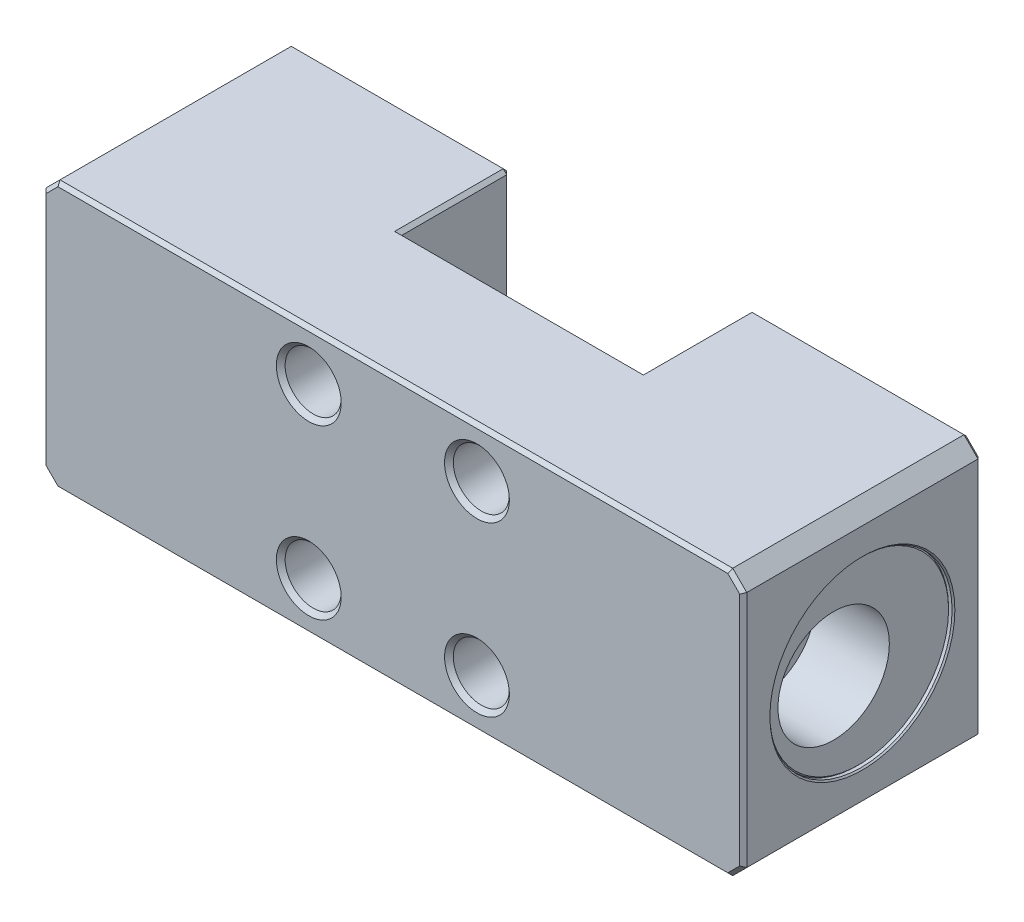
ISO-10303-21;
HEADER;
FILE_DESCRIPTION(('STEP AP214'),'2;1');
FILE_NAME('part.step','',(''),(''),'','','');
FILE_SCHEMA(('AUTOMOTIVE_DESIGN { 1 0 10303 214 1 1 1 1 }'));
ENDSEC;
DATA;
#1=APPLICATION_CONTEXT('core data for automotive mechanical design processes');
#2=APPLICATION_PROTOCOL_DEFINITION('international standard','automotive_design',2000,#1);
#3=PRODUCT_CONTEXT('',#1,'mechanical');
#4=PRODUCT('Part','Part','',(#3));
#5=PRODUCT_RELATED_PRODUCT_CATEGORY('part','',(#4));
#6=PRODUCT_DEFINITION_FORMATION('','',#4);
#7=PRODUCT_DEFINITION_CONTEXT('part definition',#1,'design');
#8=PRODUCT_DEFINITION('design','',#6,#7);
#9=PRODUCT_DEFINITION_SHAPE('','',#8);
#10=(LENGTH_UNIT() NAMED_UNIT(*) SI_UNIT(.MILLI.,.METRE.));
#11=(NAMED_UNIT(*) PLANE_ANGLE_UNIT() SI_UNIT($,.RADIAN.));
#12=(NAMED_UNIT(*) SI_UNIT($,.STERADIAN.) SOLID_ANGLE_UNIT());
#13=UNCERTAINTY_MEASURE_WITH_UNIT(LENGTH_MEASURE(1.E-05),#10,'distance_accuracy_value','');
#14=(GEOMETRIC_REPRESENTATION_CONTEXT(3) GLOBAL_UNCERTAINTY_ASSIGNED_CONTEXT((#13)) GLOBAL_UNIT_ASSIGNED_CONTEXT((#10,
#11,#12)) REPRESENTATION_CONTEXT('',''));
#15=CARTESIAN_POINT('',(0.,0.,0.));
#16=DIRECTION('',(0.,0.,1.));
#17=DIRECTION('',(1.,0.,0.));
#18=AXIS2_PLACEMENT_3D('',#15,#16,#17);
#19=CARTESIAN_POINT('',(-16.7,0.,1.5));
#20=DIRECTION('',(-1.,0.,0.));
#21=DIRECTION('',(0.,0.,-1.));
#22=AXIS2_PLACEMENT_3D('',#19,#20,#21);
#23=CYLINDRICAL_SURFACE('',#22,13.);
#24=DIRECTION('',(-1.,0.,0.));
#25=VECTOR('',#24,1.);
#26=CARTESIAN_POINT('',(-16.7,12.913171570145,0.));
#27=LINE('',#26,#25);
#28=CARTESIAN_POINT('',(-17.5,12.913171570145,0.));
#29=VERTEX_POINT('',#28);
#30=CARTESIAN_POINT('',(-17.25,12.913171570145,0.));
#31=VERTEX_POINT('',#30);
#32=EDGE_CURVE('E1286',#29,#31,#27,.F.);
#33=ORIENTED_EDGE('',*,*,#32,.F.);
#34=CARTESIAN_POINT('',(-17.5,0.,1.49999999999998));
#35=DIRECTION('',(1.,0.,0.));
#36=DIRECTION('',(0.,1.,0.));
#37=AXIS2_PLACEMENT_3D('',#34,#35,#36);
#38=CIRCLE('',#37,13.);
#39=CARTESIAN_POINT('',(-17.5,-12.9131715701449,0.));
#40=VERTEX_POINT('',#39);
#41=EDGE_CURVE('E546',#29,#40,#38,.F.);
#42=ORIENTED_EDGE('',*,*,#41,.T.);
#43=DIRECTION('',(-1.,0.,0.));
#44=VECTOR('',#43,1.);
#45=CARTESIAN_POINT('',(-16.7,-12.913171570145,0.));
#46=LINE('',#45,#44);
#47=CARTESIAN_POINT('',(-17.25,-12.913171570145,0.));
#48=VERTEX_POINT('',#47);
#49=EDGE_CURVE('E1291',#48,#40,#46,.T.);
#50=ORIENTED_EDGE('',*,*,#49,.F.);
#51=CARTESIAN_POINT('',(-17.25,0.,1.5));
#52=DIRECTION('',(-1.,0.,0.));
#53=DIRECTION('',(0.,0.,-1.));
#54=AXIS2_PLACEMENT_3D('',#51,#52,#53);
#55=CIRCLE('',#54,13.);
#56=EDGE_CURVE('E596',#31,#48,#55,.T.);
#57=ORIENTED_EDGE('',*,*,#56,.F.);
#58=EDGE_LOOP('',(#33,#42,#50,#57));
#59=FACE_BOUND('',#58,.T.);
#60=ADVANCED_FACE('F14',(#59),#23,.F.);
#61=CARTESIAN_POINT('',(-17.,0.,1.49999999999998));
#62=DIRECTION('',(1.,0.,0.));
#63=DIRECTION('',(0.,1.,0.));
#64=AXIS2_PLACEMENT_3D('',#61,#62,#63);
#65=PLANE('',#64);
#66=CARTESIAN_POINT('',(-17.,0.,1.49999999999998));
#67=DIRECTION('',(1.,0.,0.));
#68=DIRECTION('',(0.,1.,0.));
#69=AXIS2_PLACEMENT_3D('',#66,#67,#68);
#70=CIRCLE('',#69,12.5);
#71=CARTESIAN_POINT('',(-17.,-12.4096736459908,0.));
#72=VERTEX_POINT('',#71);
#73=CARTESIAN_POINT('',(-17.,12.4096736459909,0.));
#74=VERTEX_POINT('',#73);
#75=EDGE_CURVE('E535',#72,#74,#70,.T.);
#76=ORIENTED_EDGE('',*,*,#75,.T.);
#77=DIRECTION('',(0.,-1.,0.));
#78=VECTOR('',#77,1.);
#79=CARTESIAN_POINT('',(-17.,0.,0.));
#80=LINE('',#79,#78);
#81=EDGE_CURVE('E536',#74,#72,#80,.T.);
#82=ORIENTED_EDGE('',*,*,#81,.T.);
#83=EDGE_LOOP('',(#76,#82));
#84=FACE_BOUND('',#83,.T.);
#85=ADVANCED_FACE('F347',(#84),#65,.T.);
#86=CARTESIAN_POINT('',(-17.,0.,1.49999999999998));
#87=DIRECTION('',(-1.,0.,0.));
#88=DIRECTION('',(0.,-1.,0.));
#89=AXIS2_PLACEMENT_3D('',#86,#87,#88);
#90=CONICAL_SURFACE('',#89,12.5,0.785398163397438);
#91=ORIENTED_EDGE('',*,*,#41,.F.);
#92=CARTESIAN_POINT('',(-33.103084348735,28.5637258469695,0.));
#93=CARTESIAN_POINT('',(-32.1292907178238,27.5885801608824,0.));
#94=CARTESIAN_POINT('',(-31.1555560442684,26.6133755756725,0.));
#95=CARTESIAN_POINT('',(-29.2082710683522,24.6627663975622,0.));
#96=CARTESIAN_POINT('',(-28.2347207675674,23.6873618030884,0.));
#97=CARTESIAN_POINT('',(-26.2877059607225,21.7361049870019,0.));
#98=CARTESIAN_POINT('',(-25.3142415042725,20.760252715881,0.));
#99=CARTESIAN_POINT('',(-23.3677264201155,18.8081510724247,0.));
#100=CARTESIAN_POINT('',(-22.3946757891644,17.8319017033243,0.));
#101=CARTESIAN_POINT('',(-20.4237670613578,15.8532150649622,0.));
#102=CARTESIAN_POINT('',(-19.4259259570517,14.8507608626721,0.));
#103=CARTESIAN_POINT('',(-17.9300738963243,13.3461503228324,0.));
#104=CARTESIAN_POINT('',(-17.4316019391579,12.8444523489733,0.));
#105=CARTESIAN_POINT('',(-16.4350992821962,11.8406206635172,0.));
#106=CARTESIAN_POINT('',(-15.9370685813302,11.3384869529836,0.));
#107=CARTESIAN_POINT('',(-14.9417119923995,10.3336389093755,0.));
#108=CARTESIAN_POINT('',(-14.4443860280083,9.83092465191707,0.));
#109=CARTESIAN_POINT('',(-13.4507240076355,8.82450842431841,0.));
#110=CARTESIAN_POINT('',(-12.9543879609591,8.32080644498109,0.));
#111=CARTESIAN_POINT('',(-12.2111670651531,7.56401422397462,0.));
#112=CARTESIAN_POINT('',(-11.9636459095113,7.31154902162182,0.));
#113=CARTESIAN_POINT('',(-11.4691849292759,6.80605013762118,0.));
#114=CARTESIAN_POINT('',(-11.2222451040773,6.55301645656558,0.));
#115=CARTESIAN_POINT('',(-10.7291786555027,6.04616516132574,0.));
#116=CARTESIAN_POINT('',(-10.4830520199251,5.79234755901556,0.));
#117=CARTESIAN_POINT('',(-9.99197209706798,5.28358032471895,0.));
#118=CARTESIAN_POINT('',(-9.74701880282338,5.02863069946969,0.));
#119=CARTESIAN_POINT('',(-9.437056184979,4.70371591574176,0.));
#120=CARTESIAN_POINT('',(-9.37120421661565,4.63455456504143,0.));
#121=CARTESIAN_POINT('',(-9.23965387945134,4.49608579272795,0.));
#122=CARTESIAN_POINT('',(-9.17395551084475,4.42677837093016,0.));
#123=CARTESIAN_POINT('',(-8.97711966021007,4.21860732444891,0.));
#124=CARTESIAN_POINT('',(-8.84624306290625,4.07949662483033,0.));
#125=CARTESIAN_POINT('',(-8.58575833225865,3.80077288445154,0.));
#126=CARTESIAN_POINT('',(-8.45614777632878,3.66116210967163,0.));
#127=CARTESIAN_POINT('',(-8.19819394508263,3.38077989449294,0.));
#128=CARTESIAN_POINT('',(-8.06985062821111,3.240008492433,0.));
#129=CARTESIAN_POINT('',(-7.85710971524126,3.0036447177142,0.));
#130=CARTESIAN_POINT('',(-7.77221195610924,2.90850293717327,0.));
#131=CARTESIAN_POINT('',(-7.60348021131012,2.7172815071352,0.));
#132=CARTESIAN_POINT('',(-7.51964620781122,2.62120187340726,0.));
#133=CARTESIAN_POINT('',(-7.3529856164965,2.42734293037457,0.));
#134=CARTESIAN_POINT('',(-7.27016604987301,2.32955756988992,0.));
#135=CARTESIAN_POINT('',(-7.10652248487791,2.13236797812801,0.));
#136=CARTESIAN_POINT('',(-7.02569794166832,2.03296420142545,0.));
#137=CARTESIAN_POINT('',(-6.86613069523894,1.8309700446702,0.));
#138=CARTESIAN_POINT('',(-6.78741466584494,1.72835850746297,0.));
#139=CARTESIAN_POINT('',(-6.63417805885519,1.51979209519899,0.));
#140=CARTESIAN_POINT('',(-6.55966287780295,1.4138331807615,0.));
#141=CARTESIAN_POINT('',(-6.45330735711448,1.25181191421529,0.));
#142=CARTESIAN_POINT('',(-6.41885838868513,1.19746683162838,0.));
#143=CARTESIAN_POINT('',(-6.35218565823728,1.08743430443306,0.));
#144=CARTESIAN_POINT('',(-6.31996140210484,1.03174716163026,0.));
#145=CARTESIAN_POINT('',(-6.25845675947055,0.91891338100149,0.));
#146=CARTESIAN_POINT('',(-6.22917016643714,0.861770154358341,0.));
#147=CARTESIAN_POINT('',(-6.17436076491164,0.745719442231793,0.));
#148=CARTESIAN_POINT('',(-6.14883566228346,0.686813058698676,0.));
#149=CARTESIAN_POINT('',(-6.10831444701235,0.581733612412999,0.));
#150=CARTESIAN_POINT('',(-6.09226971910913,0.535967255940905,0.));
#151=CARTESIAN_POINT('',(-6.06353663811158,0.443376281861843,0.));
#152=CARTESIAN_POINT('',(-6.05084840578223,0.396551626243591,0.));
#153=CARTESIAN_POINT('',(-6.0294513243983,0.302194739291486,0.));
#154=CARTESIAN_POINT('',(-6.02072603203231,0.25466629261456,0.));
#155=CARTESIAN_POINT('',(-6.00766140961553,0.159012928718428,0.));
#156=CARTESIAN_POINT('',(-6.00332089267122,0.110888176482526,0.));
#157=CARTESIAN_POINT('',(-5.99928074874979,0.0140787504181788,0.));
#158=CARTESIAN_POINT('',(-5.99961614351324,-0.0346074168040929,0.));
#159=CARTESIAN_POINT('',(-6.0049909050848,-0.131716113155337,0.));
#160=CARTESIAN_POINT('',(-6.01003047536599,-0.180138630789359,0.));
#161=CARTESIAN_POINT('',(-6.02451877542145,-0.276467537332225,0.));
#162=CARTESIAN_POINT('',(-6.03398159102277,-0.324371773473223,0.));
#163=CARTESIAN_POINT('',(-6.05680274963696,-0.419232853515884,0.));
#164=CARTESIAN_POINT('',(-6.07016168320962,-0.466189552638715,0.));
#165=CARTESIAN_POINT('',(-6.11437473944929,-0.602925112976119,0.));
#166=CARTESIAN_POINT('',(-6.14982823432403,-0.691215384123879,0.));
#167=CARTESIAN_POINT('',(-6.2292693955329,-0.863873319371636,0.));
#168=CARTESIAN_POINT('',(-6.27327155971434,-0.948234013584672,0.));
#169=CARTESIAN_POINT('',(-6.36734702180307,-1.11431387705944,0.));
#170=CARTESIAN_POINT('',(-6.4174643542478,-1.19600778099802,0.));
#171=CARTESIAN_POINT('',(-6.49559262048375,-1.31655481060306,0.));
#172=CARTESIAN_POINT('',(-6.5221171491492,-1.35639060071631,0.));
#173=CARTESIAN_POINT('',(-6.57600428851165,-1.43549036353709,0.));
#174=CARTESIAN_POINT('',(-6.603366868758,-1.47475435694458,0.));
#175=CARTESIAN_POINT('',(-6.69110194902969,-1.59827373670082,0.));
#176=CARTESIAN_POINT('',(-6.75276563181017,-1.68161138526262,0.));
#177=CARTESIAN_POINT('',(-6.87840819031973,-1.84652848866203,0.));
#178=CARTESIAN_POINT('',(-6.94238744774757,-1.92810765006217,0.));
#179=CARTESIAN_POINT('',(-7.07206923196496,-2.08994857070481,0.));
#180=CARTESIAN_POINT('',(-7.13777261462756,-2.17020964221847,0.));
#181=CARTESIAN_POINT('',(-7.27045558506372,-2.32967171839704,0.));
#182=CARTESIAN_POINT('',(-7.33743522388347,-2.40887268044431,0.));
#183=CARTESIAN_POINT('',(-7.54007423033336,-2.64551539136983,0.));
#184=CARTESIAN_POINT('',(-7.67719515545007,-2.80170409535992,0.));
#185=CARTESIAN_POINT('',(-7.95381330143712,-3.11186278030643,0.));
#186=CARTESIAN_POINT('',(-8.09330979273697,-3.26583341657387,0.));
#187=CARTESIAN_POINT('',(-8.37356799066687,-3.57187554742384,0.));
#188=CARTESIAN_POINT('',(-8.51432542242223,-3.72395096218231,0.));
#189=CARTESIAN_POINT('',(-8.79699106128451,-4.02704779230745,0.));
#190=CARTESIAN_POINT('',(-8.93889935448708,-4.17806912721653,0.));
#191=CARTESIAN_POINT('',(-9.22338721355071,-4.47915301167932,0.));
#192=CARTESIAN_POINT('',(-9.36596583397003,-4.6292164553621,0.));
#193=CARTESIAN_POINT('',(-9.65174608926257,-4.92874107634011,0.));
#194=CARTESIAN_POINT('',(-9.79494770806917,-5.07820226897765,0.));
#195=CARTESIAN_POINT('',(-10.223808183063,-5.52437747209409,0.));
#196=CARTESIAN_POINT('',(-10.5101736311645,-5.8204120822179,0.));
#197=CARTESIAN_POINT('',(-11.084091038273,-6.41132951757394,0.));
#198=CARTESIAN_POINT('',(-11.3716430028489,-6.70621233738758,0.));
#199=CARTESIAN_POINT('',(-11.9475569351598,-7.29519783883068,0.));
#200=CARTESIAN_POINT('',(-12.2359189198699,-7.58930050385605,0.));
#201=CARTESIAN_POINT('',(-12.8132112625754,-8.17694761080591,0.));
#202=CARTESIAN_POINT('',(-13.1021416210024,-8.47049205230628,0.));
#203=CARTESIAN_POINT('',(-13.9698083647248,-9.35078577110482,0.));
#204=CARTESIAN_POINT('',(-14.5491593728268,-9.93692911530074,0.));
#205=CARTESIAN_POINT('',(-15.7087969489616,-11.1082771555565,0.));
#206=CARTESIAN_POINT('',(-16.2890835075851,-11.6934818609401,0.));
#207=CARTESIAN_POINT('',(-17.4500988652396,-12.8631291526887,0.));
#208=CARTESIAN_POINT('',(-18.0308274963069,-13.4475719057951,0.));
#209=CARTESIAN_POINT('',(-19.192693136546,-14.6160543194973,0.));
#210=CARTESIAN_POINT('',(-19.7738301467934,-15.2000939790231,0.));
#211=CARTESIAN_POINT('',(-21.5175127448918,-16.9516407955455,0.));
#212=CARTESIAN_POINT('',(-22.6804806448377,-18.1187275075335,0.));
#213=CARTESIAN_POINT('',(-24.614942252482,-20.0590212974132,0.));
#214=CARTESIAN_POINT('',(-25.3862643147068,-20.832399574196,0.));
#215=CARTESIAN_POINT('',(-26.9291355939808,-22.3789863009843,0.));
#216=CARTESIAN_POINT('',(-27.7006848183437,-23.1521947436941,0.));
#217=CARTESIAN_POINT('',(-29.2439939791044,-24.6985338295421,0.));
#218=CARTESIAN_POINT('',(-30.0157539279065,-25.4716644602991,0.));
#219=CARTESIAN_POINT('',(-31.5593574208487,-27.0177852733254,0.));
#220=CARTESIAN_POINT('',(-32.3312009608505,-27.7907754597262,0.));
#221=CARTESIAN_POINT('',(-33.103084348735,-28.5637258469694,0.));
#222=B_SPLINE_CURVE_WITH_KNOTS('',3,(#92,#93,#94,#95,#96,#97,#98,#99,#100,#101,#102,#103,#104,
#105,#106,#107,#108,#109,#110,#111,#112,#113,#114,#115,#116,#117,#118,#119,#120,#121,#122,#123,
#124,#125,#126,#127,#128,#129,#130,#131,#132,#133,#134,#135,#136,#137,#138,#139,#140,#141,#142,
#143,#144,#145,#146,#147,#148,#149,#150,#151,#152,#153,#154,#155,#156,#157,#158,#159,#160,#161,
#162,#163,#164,#165,#166,#167,#168,#169,#170,#171,#172,#173,#174,#175,#176,#177,#178,#179,#180,
#181,#182,#183,#184,#185,#186,#187,#188,#189,#190,#191,#192,#193,#194,#195,#196,#197,#198,#199,
#200,#201,#202,#203,#204,#205,#206,#207,#208,#209,#210,#211,#212,#213,#214,#215,#216,#217,#218,
#219,#220,#221),.UNSPECIFIED.,.F.,.F.,(4,2,2,2,2,2,2,2,2,2,2,2,2,2,2,2,2,2,2,2,2,2,2,2,2,2,2,2,
2,2,2,2,2,2,2,2,2,2,2,2,2,2,2,2,2,2,2,2,2,2,2,2,2,2,2,2,2,2,2,2,2,2,2,2,4),(0.,4.13432563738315,
8.26868515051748,12.4038133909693,16.5389085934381,20.7821862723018,22.9038779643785,
25.0255644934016,27.147000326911,29.268456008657,30.3291384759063,31.3898198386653,
32.4504852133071,33.5111442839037,33.7976366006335,34.0841292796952,34.6571217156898,
35.2286152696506,35.800090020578,36.1826235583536,36.5651506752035,36.9495672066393,
37.3338775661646,37.7217964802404,38.1102028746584,38.3031950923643,38.496144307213,
38.6886768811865,38.881091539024,39.0264780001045,39.171869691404,39.3166524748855,
39.46139605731,39.6072243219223,39.7530588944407,39.8993610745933,40.0456854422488,
40.330356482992,40.6155145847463,40.9028628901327,41.0464317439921,41.1899953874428,
41.5009422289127,41.8119405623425,42.123096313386,42.4342645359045,43.0577337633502,
43.6810148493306,44.3026621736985,44.9243564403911,45.5453446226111,46.1663168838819,
47.4019379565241,48.6375648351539,49.8732178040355,51.1088717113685,53.5812983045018,
56.053700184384,58.5254141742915,60.9971346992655,65.9399341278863,69.2167412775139,
72.4936689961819,75.7708780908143,79.0479661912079),.UNSPECIFIED.);
#223=EDGE_CURVE('E245',#29,#74,#222,.T.);
#224=ORIENTED_EDGE('',*,*,#223,.T.);
#225=ORIENTED_EDGE('',*,*,#75,.F.);
#226=EDGE_CURVE('E247',#72,#40,#222,.T.);
#227=ORIENTED_EDGE('',*,*,#226,.T.);
#228=EDGE_LOOP('',(#91,#224,#225,#227));
#229=FACE_BOUND('',#228,.T.);
#230=ADVANCED_FACE('F262',(#229),#90,.T.);
#231=CARTESIAN_POINT('',(12.,12.,20.));
#232=DIRECTION('',(0.,0.,-1.));
#233=DIRECTION('',(1.,0.,0.));
#234=AXIS2_PLACEMENT_3D('',#231,#232,#233);
#235=CYLINDRICAL_SURFACE('',#234,4.);
#236=CARTESIAN_POINT('',(12.,12.,17.875));
#237=DIRECTION('',(0.,0.,1.));
#238=DIRECTION('',(0.,-1.,0.));
#239=AXIS2_PLACEMENT_3D('',#236,#237,#238);
#240=CIRCLE('',#239,4.);
#241=CARTESIAN_POINT('',(12.,8.,17.875));
#242=VERTEX_POINT('',#241);
#243=EDGE_CURVE('E579',#242,#242,#240,.F.);
#244=ORIENTED_EDGE('',*,*,#243,.F.);
#245=EDGE_LOOP('',(#244));
#246=FACE_BOUND('',#245,.T.);
#247=CARTESIAN_POINT('',(12.,12.,4.5));
#248=DIRECTION('',(0.,0.,-1.));
#249=DIRECTION('',(1.,0.,0.));
#250=AXIS2_PLACEMENT_3D('',#247,#248,#249);
#251=CIRCLE('',#250,4.);
#252=CARTESIAN_POINT('',(16.,12.,4.5));
#253=VERTEX_POINT('',#252);
#254=EDGE_CURVE('E253',#253,#253,#251,.F.);
#255=ORIENTED_EDGE('',*,*,#254,.F.);
#256=EDGE_LOOP('',(#255));
#257=FACE_BOUND('',#256,.T.);
#258=ADVANCED_FACE('F314',(#246,#257),#235,.F.);
#259=CARTESIAN_POINT('',(-12.,12.,20.));
#260=DIRECTION('',(0.,0.,-1.));
#261=DIRECTION('',(1.,0.,0.));
#262=AXIS2_PLACEMENT_3D('',#259,#260,#261);
#263=CYLINDRICAL_SURFACE('',#262,4.);
#264=CARTESIAN_POINT('',(-12.,12.,17.875));
#265=DIRECTION('',(0.,0.,1.));
#266=DIRECTION('',(0.,-1.,0.));
#267=AXIS2_PLACEMENT_3D('',#264,#265,#266);
#268=CIRCLE('',#267,4.);
#269=CARTESIAN_POINT('',(-12.,8.,17.875));
#270=VERTEX_POINT('',#269);
#271=EDGE_CURVE('E1316',#270,#270,#268,.F.);
#272=ORIENTED_EDGE('',*,*,#271,.F.);
#273=EDGE_LOOP('',(#272));
#274=FACE_BOUND('',#273,.T.);
#275=CARTESIAN_POINT('',(-12.,12.,4.5));
#276=DIRECTION('',(0.,0.,-1.));
#277=DIRECTION('',(1.,0.,0.));
#278=AXIS2_PLACEMENT_3D('',#275,#276,#277);
#279=CIRCLE('',#278,4.);
#280=CARTESIAN_POINT('',(-8.,12.,4.5));
#281=VERTEX_POINT('',#280);
#282=EDGE_CURVE('E557',#281,#281,#279,.F.);
#283=ORIENTED_EDGE('',*,*,#282,.F.);
#284=EDGE_LOOP('',(#283));
#285=FACE_BOUND('',#284,.T.);
#286=ADVANCED_FACE('F310',(#274,#285),#263,.F.);
#287=CARTESIAN_POINT('',(12.,-12.,20.));
#288=DIRECTION('',(0.,0.,-1.));
#289=DIRECTION('',(1.,0.,0.));
#290=AXIS2_PLACEMENT_3D('',#287,#288,#289);
#291=CYLINDRICAL_SURFACE('',#290,4.);
#292=CARTESIAN_POINT('',(12.,-12.,17.875));
#293=DIRECTION('',(0.,0.,1.));
#294=DIRECTION('',(0.,-1.,0.));
#295=AXIS2_PLACEMENT_3D('',#292,#293,#294);
#296=CIRCLE('',#295,4.);
#297=CARTESIAN_POINT('',(12.,-16.,17.875));
#298=VERTEX_POINT('',#297);
#299=EDGE_CURVE('E551',#298,#298,#296,.F.);
#300=ORIENTED_EDGE('',*,*,#299,.F.);
#301=EDGE_LOOP('',(#300));
#302=FACE_BOUND('',#301,.T.);
#303=CARTESIAN_POINT('',(12.,-12.,4.5));
#304=DIRECTION('',(0.,0.,-1.));
#305=DIRECTION('',(1.,0.,0.));
#306=AXIS2_PLACEMENT_3D('',#303,#304,#305);
#307=CIRCLE('',#306,4.);
#308=CARTESIAN_POINT('',(16.,-12.,4.5));
#309=VERTEX_POINT('',#308);
#310=EDGE_CURVE('E555',#309,#309,#307,.F.);
#311=ORIENTED_EDGE('',*,*,#310,.F.);
#312=EDGE_LOOP('',(#311));
#313=FACE_BOUND('',#312,.T.);
#314=ADVANCED_FACE('F313',(#302,#313),#291,.F.);
#315=CARTESIAN_POINT('',(-12.,-12.,20.));
#316=DIRECTION('',(0.,0.,-1.));
#317=DIRECTION('',(1.,0.,0.));
#318=AXIS2_PLACEMENT_3D('',#315,#316,#317);
#319=CYLINDRICAL_SURFACE('',#318,4.);
#320=CARTESIAN_POINT('',(-12.,-12.,17.875));
#321=DIRECTION('',(0.,0.,1.));
#322=DIRECTION('',(0.,-1.,0.));
#323=AXIS2_PLACEMENT_3D('',#320,#321,#322);
#324=CIRCLE('',#323,4.);
#325=CARTESIAN_POINT('',(-12.,-16.,17.875));
#326=VERTEX_POINT('',#325);
#327=EDGE_CURVE('E575',#326,#326,#324,.F.);
#328=ORIENTED_EDGE('',*,*,#327,.F.);
#329=EDGE_LOOP('',(#328));
#330=FACE_BOUND('',#329,.T.);
#331=CARTESIAN_POINT('',(-12.,-12.,4.5));
#332=DIRECTION('',(0.,0.,-1.));
#333=DIRECTION('',(1.,0.,0.));
#334=AXIS2_PLACEMENT_3D('',#331,#332,#333);
#335=CIRCLE('',#334,4.);
#336=CARTESIAN_POINT('',(-8.,-12.,4.5));
#337=VERTEX_POINT('',#336);
#338=EDGE_CURVE('E230',#337,#337,#335,.F.);
#339=ORIENTED_EDGE('',*,*,#338,.F.);
#340=EDGE_LOOP('',(#339));
#341=FACE_BOUND('',#340,.T.);
#342=ADVANCED_FACE('F319',(#330,#341),#319,.F.);
#343=CARTESIAN_POINT('',(-67.6464466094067,-1.35355339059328,-15.5));
#344=DIRECTION('',(0.5,-0.5,0.70710678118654));
#345=DIRECTION('',(0.,-0.816496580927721,-0.577350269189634));
#346=AXIS2_PLACEMENT_3D('',#343,#344,#345);
#347=PLANE('',#346);
#348=DIRECTION('',(-0.678598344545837,0.281084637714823,0.678598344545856));
#349=VECTOR('',#348,1.);
#350=CARTESIAN_POINT('',(-54.3950428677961,18.8204863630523,-10.6049571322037));
#351=LINE('',#350,#349);
#352=CARTESIAN_POINT('',(-49.5,16.7928932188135,-15.5));
#353=VERTEX_POINT('',#352);
#354=CARTESIAN_POINT('',(-50.,17.,-15.));
#355=VERTEX_POINT('',#354);
#356=EDGE_CURVE('E825',#353,#355,#351,.T.);
#357=ORIENTED_EDGE('',*,*,#356,.T.);
#358=DIRECTION('',(0.707106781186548,0.707106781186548,0.));
#359=VECTOR('',#358,1.);
#360=CARTESIAN_POINT('',(-50.,17.,-15.));
#361=LINE('',#360,#359);
#362=CARTESIAN_POINT('',(-48.,19.,-15.));
#363=VERTEX_POINT('',#362);
#364=EDGE_CURVE('E652',#363,#355,#361,.F.);
#365=ORIENTED_EDGE('',*,*,#364,.F.);
#366=DIRECTION('',(-0.281084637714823,0.678598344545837,0.678598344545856));
#367=VECTOR('',#366,1.);
#368=CARTESIAN_POINT('',(-47.967273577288,18.9209914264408,-15.0790085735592));
#369=LINE('',#368,#367);
#370=CARTESIAN_POINT('',(-47.7928932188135,18.5,-15.5));
#371=VERTEX_POINT('',#370);
#372=EDGE_CURVE('E819',#371,#363,#369,.T.);
#373=ORIENTED_EDGE('',*,*,#372,.F.);
#374=DIRECTION('',(0.707106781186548,0.707106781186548,0.));
#375=VECTOR('',#374,1.);
#376=CARTESIAN_POINT('',(-47.6464466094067,18.6464466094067,-15.5));
#377=LINE('',#376,#375);
#378=EDGE_CURVE('E721',#353,#371,#377,.T.);
#379=ORIENTED_EDGE('',*,*,#378,.F.);
#380=EDGE_LOOP('',(#357,#365,#373,#379));
#381=FACE_BOUND('',#380,.T.);
#382=ADVANCED_FACE('F322',(#381),#347,.F.);
#383=CARTESIAN_POINT('',(-67.6464466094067,-1.35355339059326,18.5));
#384=DIRECTION('',(0.5,-0.5,-0.70710678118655));
#385=DIRECTION('',(0.816496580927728,0.,0.577350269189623));
#386=AXIS2_PLACEMENT_3D('',#383,#384,#385);
#387=PLANE('',#386);
#388=DIRECTION('',(0.281084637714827,-0.678598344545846,0.678598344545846));
#389=VECTOR('',#388,1.);
#390=CARTESIAN_POINT('',(-47.967273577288,18.9209914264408,18.0790085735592));
#391=LINE('',#390,#389);
#392=CARTESIAN_POINT('',(-47.7928932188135,18.5,18.5));
#393=VERTEX_POINT('',#392);
#394=CARTESIAN_POINT('',(-48.,19.,18.));
#395=VERTEX_POINT('',#394);
#396=EDGE_CURVE('E748',#393,#395,#391,.F.);
#397=ORIENTED_EDGE('',*,*,#396,.T.);
#398=DIRECTION('',(-0.707106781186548,-0.707106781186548,0.));
#399=VECTOR('',#398,1.);
#400=CARTESIAN_POINT('',(-48.,19.,18.));
#401=LINE('',#400,#399);
#402=CARTESIAN_POINT('',(-50.,17.,18.));
#403=VERTEX_POINT('',#402);
#404=EDGE_CURVE('E654',#403,#395,#401,.F.);
#405=ORIENTED_EDGE('',*,*,#404,.F.);
#406=DIRECTION('',(0.678598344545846,-0.281084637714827,0.678598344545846));
#407=VECTOR('',#406,1.);
#408=CARTESIAN_POINT('',(-54.3950428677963,18.8204863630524,13.6049571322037));
#409=LINE('',#408,#407);
#410=CARTESIAN_POINT('',(-49.5,16.7928932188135,18.5));
#411=VERTEX_POINT('',#410);
#412=EDGE_CURVE('E743',#411,#403,#409,.F.);
#413=ORIENTED_EDGE('',*,*,#412,.F.);
#414=DIRECTION('',(-0.707106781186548,-0.707106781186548,0.));
#415=VECTOR('',#414,1.);
#416=CARTESIAN_POINT('',(-49.6464466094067,16.6464466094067,18.5));
#417=LINE('',#416,#415);
#418=EDGE_CURVE('E647',#393,#411,#417,.T.);
#419=ORIENTED_EDGE('',*,*,#418,.F.);
#420=EDGE_LOOP('',(#397,#405,#413,#419));
#421=FACE_BOUND('',#420,.T.);
#422=ADVANCED_FACE('F370',(#421),#387,.F.);
#423=CARTESIAN_POINT('',(-50.,-19.,18.5));
#424=DIRECTION('',(0.,0.,-1.));
#425=DIRECTION('',(1.,0.,0.));
#426=AXIS2_PLACEMENT_3D('',#423,#424,#425);
#427=PLANE('',#426);
#428=ORIENTED_EDGE('',*,*,#418,.T.);
#429=DIRECTION('',(0.,-1.,0.));
#430=VECTOR('',#429,1.);
#431=CARTESIAN_POINT('',(-49.5,-19.,18.5));
#432=LINE('',#431,#430);
#433=CARTESIAN_POINT('',(-49.5,-16.7928932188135,18.5));
#434=VERTEX_POINT('',#433);
#435=EDGE_CURVE('E649',#411,#434,#432,.T.);
#436=ORIENTED_EDGE('',*,*,#435,.T.);
#437=DIRECTION('',(0.707106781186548,-0.707106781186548,0.));
#438=VECTOR('',#437,1.);
#439=CARTESIAN_POINT('',(-47.6464466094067,-18.6464466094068,18.5));
#440=LINE('',#439,#438);
#441=CARTESIAN_POINT('',(-47.7928932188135,-18.5,18.5));
#442=VERTEX_POINT('',#441);
#443=EDGE_CURVE('E637',#434,#442,#440,.T.);
#444=ORIENTED_EDGE('',*,*,#443,.T.);
#445=DIRECTION('',(1.,0.,0.));
#446=VECTOR('',#445,1.);
#447=CARTESIAN_POINT('',(48.,-18.5,18.5));
#448=LINE('',#447,#446);
#449=CARTESIAN_POINT('',(47.7928932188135,-18.5,18.5));
#450=VERTEX_POINT('',#449);
#451=EDGE_CURVE('E635',#442,#450,#448,.T.);
#452=ORIENTED_EDGE('',*,*,#451,.T.);
#453=DIRECTION('',(0.707106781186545,0.70710678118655,0.));
#454=VECTOR('',#453,1.);
#455=CARTESIAN_POINT('',(49.6464466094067,-16.6464466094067,18.5));
#456=LINE('',#455,#454);
#457=CARTESIAN_POINT('',(49.5,-16.7928932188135,18.5));
#458=VERTEX_POINT('',#457);
#459=EDGE_CURVE('E639',#450,#458,#456,.T.);
#460=ORIENTED_EDGE('',*,*,#459,.T.);
#461=DIRECTION('',(0.,1.,0.));
#462=VECTOR('',#461,1.);
#463=CARTESIAN_POINT('',(49.5,-19.,18.5));
#464=LINE('',#463,#462);
#465=CARTESIAN_POINT('',(49.5,16.7928932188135,18.5));
#466=VERTEX_POINT('',#465);
#467=EDGE_CURVE('E641',#458,#466,#464,.T.);
#468=ORIENTED_EDGE('',*,*,#467,.T.);
#469=DIRECTION('',(-0.707106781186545,0.70710678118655,0.));
#470=VECTOR('',#469,1.);
#471=CARTESIAN_POINT('',(47.6464466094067,18.6464466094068,18.5));
#472=LINE('',#471,#470);
#473=CARTESIAN_POINT('',(47.7928932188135,18.5,18.5));
#474=VERTEX_POINT('',#473);
#475=EDGE_CURVE('E643',#466,#474,#472,.T.);
#476=ORIENTED_EDGE('',*,*,#475,.T.);
#477=DIRECTION('',(-1.,0.,0.));
#478=VECTOR('',#477,1.);
#479=CARTESIAN_POINT('',(-50.,18.5,18.5));
#480=LINE('',#479,#478);
#481=EDGE_CURVE('E645',#474,#393,#480,.T.);
#482=ORIENTED_EDGE('',*,*,#481,.T.);
#483=EDGE_LOOP('',(#428,#436,#444,#452,#460,#468,#476,#482));
#484=FACE_BOUND('',#483,.T.);
#485=CARTESIAN_POINT('',(-12.,12.,18.5));
#486=DIRECTION('',(0.,0.,1.));
#487=DIRECTION('',(0.,-1.,0.));
#488=AXIS2_PLACEMENT_3D('',#485,#486,#487);
#489=CIRCLE('',#488,4.625);
#490=CARTESIAN_POINT('',(-12.,7.375,18.5));
#491=VERTEX_POINT('',#490);
#492=EDGE_CURVE('E583',#491,#491,#489,.T.);
#493=ORIENTED_EDGE('',*,*,#492,.F.);
#494=EDGE_LOOP('',(#493));
#495=FACE_BOUND('',#494,.T.);
#496=CARTESIAN_POINT('',(12.,12.,18.5));
#497=DIRECTION('',(0.,0.,1.));
#498=DIRECTION('',(0.,-1.,0.));
#499=AXIS2_PLACEMENT_3D('',#496,#497,#498);
#500=CIRCLE('',#499,4.625);
#501=CARTESIAN_POINT('',(12.,7.375,18.5));
#502=VERTEX_POINT('',#501);
#503=EDGE_CURVE('E586',#502,#502,#500,.T.);
#504=ORIENTED_EDGE('',*,*,#503,.F.);
#505=EDGE_LOOP('',(#504));
#506=FACE_BOUND('',#505,.T.);
#507=CARTESIAN_POINT('',(12.,-12.,18.5));
#508=DIRECTION('',(0.,0.,1.));
#509=DIRECTION('',(0.,-1.,0.));
#510=AXIS2_PLACEMENT_3D('',#507,#508,#509);
#511=CIRCLE('',#510,4.625);
#512=CARTESIAN_POINT('',(12.,-16.625,18.5));
#513=VERTEX_POINT('',#512);
#514=EDGE_CURVE('E590',#513,#513,#511,.T.);
#515=ORIENTED_EDGE('',*,*,#514,.F.);
#516=EDGE_LOOP('',(#515));
#517=FACE_BOUND('',#516,.T.);
#518=CARTESIAN_POINT('',(-12.,-12.,18.5));
#519=DIRECTION('',(0.,0.,1.));
#520=DIRECTION('',(0.,-1.,0.));
#521=AXIS2_PLACEMENT_3D('',#518,#519,#520);
#522=CIRCLE('',#521,4.625);
#523=CARTESIAN_POINT('',(-12.,-16.625,18.5));
#524=VERTEX_POINT('',#523);
#525=EDGE_CURVE('E593',#524,#524,#522,.T.);
#526=ORIENTED_EDGE('',*,*,#525,.F.);
#527=EDGE_LOOP('',(#526));
#528=FACE_BOUND('',#527,.T.);
#529=ADVANCED_FACE('F366',(#484,#495,#506,#517,#528),#427,.F.);
#530=CARTESIAN_POINT('',(-48.6464466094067,-17.6464466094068,-15.5));
#531=DIRECTION('',(-0.500000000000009,-0.500000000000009,-0.707106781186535));
#532=DIRECTION('',(0.,0.816496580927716,-0.57735026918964));
#533=AXIS2_PLACEMENT_3D('',#530,#531,#532);
#534=PLANE('',#533);
#535=DIRECTION('',(0.67859834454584,0.281084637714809,-0.678598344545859));
#536=VECTOR('',#535,1.);
#537=CARTESIAN_POINT('',(-49.9209914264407,-16.967273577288,-15.0790085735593));
#538=LINE('',#537,#536);
#539=CARTESIAN_POINT('',(-50.,-17.,-15.));
#540=VERTEX_POINT('',#539);
#541=CARTESIAN_POINT('',(-49.5,-16.7928932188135,-15.5));
#542=VERTEX_POINT('',#541);
#543=EDGE_CURVE('E746',#540,#542,#538,.T.);
#544=ORIENTED_EDGE('',*,*,#543,.T.);
#545=DIRECTION('',(-0.707106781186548,0.707106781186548,0.));
#546=VECTOR('',#545,1.);
#547=CARTESIAN_POINT('',(-49.6464466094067,-16.6464466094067,-15.5));
#548=LINE('',#547,#546);
#549=CARTESIAN_POINT('',(-47.7928932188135,-18.5,-15.5));
#550=VERTEX_POINT('',#549);
#551=EDGE_CURVE('E727',#550,#542,#548,.T.);
#552=ORIENTED_EDGE('',*,*,#551,.F.);
#553=DIRECTION('',(0.281084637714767,0.678598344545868,-0.678598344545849));
#554=VECTOR('',#553,1.);
#555=CARTESIAN_POINT('',(-48.1580171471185,-19.3814871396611,-14.618512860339));
#556=LINE('',#555,#554);
#557=CARTESIAN_POINT('',(-48.,-19.,-15.));
#558=VERTEX_POINT('',#557);
#559=EDGE_CURVE('E822',#558,#550,#556,.T.);
#560=ORIENTED_EDGE('',*,*,#559,.F.);
#561=DIRECTION('',(0.707106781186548,-0.707106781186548,0.));
#562=VECTOR('',#561,1.);
#563=CARTESIAN_POINT('',(-48.,-19.,-15.));
#564=LINE('',#563,#562);
#565=EDGE_CURVE('E680',#540,#558,#564,.T.);
#566=ORIENTED_EDGE('',*,*,#565,.F.);
#567=EDGE_LOOP('',(#544,#552,#560,#566));
#568=FACE_BOUND('',#567,.T.);
#569=ADVANCED_FACE('F369',(#568),#534,.T.);
#570=CARTESIAN_POINT('',(-48.6464466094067,-17.6464466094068,18.5));
#571=DIRECTION('',(-0.5,-0.5,0.707106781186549));
#572=DIRECTION('',(-0.816496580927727,0.,-0.577350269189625));
#573=AXIS2_PLACEMENT_3D('',#570,#571,#572);
#574=PLANE('',#573);
#575=DIRECTION('',(-0.281084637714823,-0.678598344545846,-0.678598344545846));
#576=VECTOR('',#575,1.);
#577=CARTESIAN_POINT('',(-48.1580171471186,-19.3814871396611,17.618512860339));
#578=LINE('',#577,#576);
#579=CARTESIAN_POINT('',(-48.,-19.,18.));
#580=VERTEX_POINT('',#579);
#581=EDGE_CURVE('E751',#580,#442,#578,.F.);
#582=ORIENTED_EDGE('',*,*,#581,.T.);
#583=ORIENTED_EDGE('',*,*,#443,.F.);
#584=DIRECTION('',(0.678598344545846,0.281084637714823,0.678598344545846));
#585=VECTOR('',#584,1.);
#586=CARTESIAN_POINT('',(-49.2697521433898,-16.6975214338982,18.7302478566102));
#587=LINE('',#586,#585);
#588=CARTESIAN_POINT('',(-50.,-17.,18.));
#589=VERTEX_POINT('',#588);
#590=EDGE_CURVE('E745',#589,#434,#587,.T.);
#591=ORIENTED_EDGE('',*,*,#590,.F.);
#592=DIRECTION('',(-0.707106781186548,0.707106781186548,0.));
#593=VECTOR('',#592,1.);
#594=CARTESIAN_POINT('',(-50.,-17.,18.));
#595=LINE('',#594,#593);
#596=EDGE_CURVE('E682',#580,#589,#595,.T.);
#597=ORIENTED_EDGE('',*,*,#596,.F.);
#598=EDGE_LOOP('',(#582,#583,#591,#597));
#599=FACE_BOUND('',#598,.T.);
#600=ADVANCED_FACE('F425',(#599),#574,.T.);
#601=CARTESIAN_POINT('',(-1.35355339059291,-67.6464466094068,18.5));
#602=DIRECTION('',(0.5,-0.5,0.707106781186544));
#603=DIRECTION('',(-0.816496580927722,0.,0.577350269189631));
#604=AXIS2_PLACEMENT_3D('',#601,#602,#603);
#605=PLANE('',#604);
#606=DIRECTION('',(0.678598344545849,-0.28108463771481,-0.678598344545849));
#607=VECTOR('',#606,1.);
#608=CARTESIAN_POINT('',(35.7821449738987,-11.1107716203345,32.2178550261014));
#609=LINE('',#608,#607);
#610=CARTESIAN_POINT('',(50.,-17.,18.));
#611=VERTEX_POINT('',#610);
#612=EDGE_CURVE('E587',#611,#458,#609,.F.);
#613=ORIENTED_EDGE('',*,*,#612,.T.);
#614=ORIENTED_EDGE('',*,*,#459,.F.);
#615=DIRECTION('',(-0.281084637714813,0.678598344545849,0.678598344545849));
#616=VECTOR('',#615,1.);
#617=CARTESIAN_POINT('',(40.2571597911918,-0.307130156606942,36.6928698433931));
#618=LINE('',#617,#616);
#619=CARTESIAN_POINT('',(48.,-19.,18.));
#620=VERTEX_POINT('',#619);
#621=EDGE_CURVE('E757',#620,#450,#618,.T.);
#622=ORIENTED_EDGE('',*,*,#621,.F.);
#623=DIRECTION('',(-0.707106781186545,-0.70710678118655,0.));
#624=VECTOR('',#623,1.);
#625=CARTESIAN_POINT('',(48.,-19.,18.));
#626=LINE('',#625,#624);
#627=EDGE_CURVE('E678',#611,#620,#626,.T.);
#628=ORIENTED_EDGE('',*,*,#627,.F.);
#629=EDGE_LOOP('',(#613,#614,#622,#628));
#630=FACE_BOUND('',#629,.T.);
#631=ADVANCED_FACE('F428',(#630),#605,.T.);
#632=CARTESIAN_POINT('',(17.6464466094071,48.6464466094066,18.5));
#633=DIRECTION('',(-0.5,-0.499999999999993,-0.707106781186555));
#634=DIRECTION('',(0.816496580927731,0.,-0.577350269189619));
#635=AXIS2_PLACEMENT_3D('',#632,#633,#634);
#636=PLANE('',#635);
#637=DIRECTION('',(-0.678598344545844,-0.281084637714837,0.678598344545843));
#638=VECTOR('',#637,1.);
#639=CARTESIAN_POINT('',(42.6727357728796,13.9649477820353,25.3272642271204));
#640=LINE('',#639,#638);
#641=CARTESIAN_POINT('',(50.,17.,18.));
#642=VERTEX_POINT('',#641);
#643=EDGE_CURVE('E760',#466,#642,#640,.F.);
#644=ORIENTED_EDGE('',*,*,#643,.T.);
#645=DIRECTION('',(-0.707106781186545,0.70710678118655,0.));
#646=VECTOR('',#645,1.);
#647=CARTESIAN_POINT('',(50.,17.,18.));
#648=LINE('',#647,#646);
#649=CARTESIAN_POINT('',(48.,19.,18.));
#650=VERTEX_POINT('',#649);
#651=EDGE_CURVE('E670',#650,#642,#648,.F.);
#652=ORIENTED_EDGE('',*,*,#651,.F.);
#653=DIRECTION('',(-0.28108463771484,-0.678598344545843,0.678598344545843));
#654=VECTOR('',#653,1.);
#655=CARTESIAN_POINT('',(51.1613063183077,26.6320685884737,10.3679314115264));
#656=LINE('',#655,#654);
#657=EDGE_CURVE('E754',#474,#650,#656,.F.);
#658=ORIENTED_EDGE('',*,*,#657,.F.);
#659=ORIENTED_EDGE('',*,*,#475,.F.);
#660=EDGE_LOOP('',(#644,#652,#658,#659));
#661=FACE_BOUND('',#660,.T.);
#662=ADVANCED_FACE('F440',(#661),#636,.F.);
#663=CARTESIAN_POINT('',(-50.,18.5,-15.5));
#664=DIRECTION('',(0.,-0.707106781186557,0.707106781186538));
#665=DIRECTION('',(0.,-0.707106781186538,-0.707106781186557));
#666=AXIS2_PLACEMENT_3D('',#663,#664,#665);
#667=PLANE('',#666);
#668=ORIENTED_EDGE('',*,*,#372,.T.);
#669=DIRECTION('',(-1.,0.,0.));
#670=VECTOR('',#669,1.);
#671=CARTESIAN_POINT('',(-50.,19.,-15.));
#672=LINE('',#671,#670);
#673=CARTESIAN_POINT('',(-17.75,19.,-15.));
#674=VERTEX_POINT('',#673);
#675=EDGE_CURVE('E662',#674,#363,#672,.T.);
#676=ORIENTED_EDGE('',*,*,#675,.F.);
#677=DIRECTION('',(0.,-0.707106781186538,-0.707106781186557));
#678=VECTOR('',#677,1.);
#679=CARTESIAN_POINT('',(-17.75,18.5,-15.5));
#680=LINE('',#679,#678);
#681=CARTESIAN_POINT('',(-17.75,18.5,-15.5));
#682=VERTEX_POINT('',#681);
#683=EDGE_CURVE('E810',#682,#674,#680,.F.);
#684=ORIENTED_EDGE('',*,*,#683,.F.);
#685=DIRECTION('',(1.,0.,0.));
#686=VECTOR('',#685,1.);
#687=CARTESIAN_POINT('',(-50.,18.5,-15.5));
#688=LINE('',#687,#686);
#689=EDGE_CURVE('E719',#371,#682,#688,.T.);
#690=ORIENTED_EDGE('',*,*,#689,.F.);
#691=EDGE_LOOP('',(#668,#676,#684,#690));
#692=FACE_BOUND('',#691,.T.);
#693=ADVANCED_FACE('F434',(#692),#667,.F.);
#694=CARTESIAN_POINT('',(-50.,18.5,18.5));
#695=DIRECTION('',(0.,-0.707106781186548,-0.707106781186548));
#696=DIRECTION('',(0.,0.707106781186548,-0.707106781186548));
#697=AXIS2_PLACEMENT_3D('',#694,#695,#696);
#698=PLANE('',#697);
#699=ORIENTED_EDGE('',*,*,#657,.T.);
#700=DIRECTION('',(1.,0.,0.));
#701=VECTOR('',#700,1.);
#702=CARTESIAN_POINT('',(-50.,19.,18.));
#703=LINE('',#702,#701);
#704=EDGE_CURVE('E666',#395,#650,#703,.T.);
#705=ORIENTED_EDGE('',*,*,#704,.F.);
#706=ORIENTED_EDGE('',*,*,#396,.F.);
#707=ORIENTED_EDGE('',*,*,#481,.F.);
#708=EDGE_LOOP('',(#699,#705,#706,#707));
#709=FACE_BOUND('',#708,.T.);
#710=ADVANCED_FACE('F430',(#709),#698,.F.);
#711=CARTESIAN_POINT('',(-50.,-19.,-15.));
#712=DIRECTION('',(0.,-0.707106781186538,-0.707106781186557));
#713=DIRECTION('',(0.,0.707106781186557,-0.707106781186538));
#714=AXIS2_PLACEMENT_3D('',#711,#712,#713);
#715=PLANE('',#714);
#716=ORIENTED_EDGE('',*,*,#559,.T.);
#717=DIRECTION('',(-1.,0.,0.));
#718=VECTOR('',#717,1.);
#719=CARTESIAN_POINT('',(-48.,-18.5,-15.5));
#720=LINE('',#719,#718);
#721=CARTESIAN_POINT('',(-17.75,-18.5,-15.5));
#722=VERTEX_POINT('',#721);
#723=EDGE_CURVE('E725',#722,#550,#720,.T.);
#724=ORIENTED_EDGE('',*,*,#723,.F.);
#725=DIRECTION('',(0.,0.707106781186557,-0.707106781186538));
#726=VECTOR('',#725,1.);
#727=CARTESIAN_POINT('',(-17.75,-19.,-15.));
#728=LINE('',#727,#726);
#729=CARTESIAN_POINT('',(-17.75,-19.,-15.));
#730=VERTEX_POINT('',#729);
#731=EDGE_CURVE('E813',#730,#722,#728,.T.);
#732=ORIENTED_EDGE('',*,*,#731,.F.);
#733=DIRECTION('',(1.,0.,0.));
#734=VECTOR('',#733,1.);
#735=CARTESIAN_POINT('',(-17.25,-19.,-15.));
#736=LINE('',#735,#734);
#737=EDGE_CURVE('E690',#558,#730,#736,.T.);
#738=ORIENTED_EDGE('',*,*,#737,.F.);
#739=EDGE_LOOP('',(#716,#724,#732,#738));
#740=FACE_BOUND('',#739,.T.);
#741=ADVANCED_FACE('F433',(#740),#715,.T.);
#742=CARTESIAN_POINT('',(-49.5,-19.,-15.5));
#743=DIRECTION('',(0.707106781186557,0.,0.707106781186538));
#744=DIRECTION('',(-0.707106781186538,0.,0.707106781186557));
#745=AXIS2_PLACEMENT_3D('',#742,#743,#744);
#746=PLANE('',#745);
#747=ORIENTED_EDGE('',*,*,#356,.F.);
#748=DIRECTION('',(0.,1.,0.));
#749=VECTOR('',#748,1.);
#750=CARTESIAN_POINT('',(-49.5,-19.,-15.5));
#751=LINE('',#750,#749);
#752=EDGE_CURVE('E723',#542,#353,#751,.T.);
#753=ORIENTED_EDGE('',*,*,#752,.F.);
#754=ORIENTED_EDGE('',*,*,#543,.F.);
#755=DIRECTION('',(0.,-1.,0.));
#756=VECTOR('',#755,1.);
#757=CARTESIAN_POINT('',(-50.,-19.,-15.));
#758=LINE('',#757,#756);
#759=EDGE_CURVE('E630',#355,#540,#758,.T.);
#760=ORIENTED_EDGE('',*,*,#759,.F.);
#761=EDGE_LOOP('',(#747,#753,#754,#760));
#762=FACE_BOUND('',#761,.T.);
#763=ADVANCED_FACE('F408',(#762),#746,.F.);
#764=CARTESIAN_POINT('',(-50.,17.,18.5));
#765=DIRECTION('',(0.707106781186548,-0.707106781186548,0.));
#766=DIRECTION('',(0.707106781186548,0.707106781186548,0.));
#767=AXIS2_PLACEMENT_3D('',#764,#765,#766);
#768=PLANE('',#767);
#769=DIRECTION('',(0.,0.,-1.));
#770=VECTOR('',#769,1.);
#771=CARTESIAN_POINT('',(-50.,17.,18.5));
#772=LINE('',#771,#770);
#773=EDGE_CURVE('E609',#403,#355,#772,.T.);
#774=ORIENTED_EDGE('',*,*,#773,.F.);
#775=ORIENTED_EDGE('',*,*,#404,.T.);
#776=DIRECTION('',(0.,0.,1.));
#777=VECTOR('',#776,1.);
#778=CARTESIAN_POINT('',(-48.,19.,-15.5));
#779=LINE('',#778,#777);
#780=EDGE_CURVE('E615',#363,#395,#779,.T.);
#781=ORIENTED_EDGE('',*,*,#780,.F.);
#782=ORIENTED_EDGE('',*,*,#364,.T.);
#783=EDGE_LOOP('',(#774,#775,#781,#782));
#784=FACE_BOUND('',#783,.T.);
#785=ADVANCED_FACE('F404',(#784),#768,.F.);
#786=CARTESIAN_POINT('',(-50.,-19.,18.));
#787=DIRECTION('',(0.707106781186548,0.,-0.707106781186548));
#788=DIRECTION('',(0.707106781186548,0.,0.707106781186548));
#789=AXIS2_PLACEMENT_3D('',#786,#787,#788);
#790=PLANE('',#789);
#791=ORIENTED_EDGE('',*,*,#590,.T.);
#792=ORIENTED_EDGE('',*,*,#435,.F.);
#793=ORIENTED_EDGE('',*,*,#412,.T.);
#794=DIRECTION('',(0.,1.,0.));
#795=VECTOR('',#794,1.);
#796=CARTESIAN_POINT('',(-50.,-19.,18.));
#797=LINE('',#796,#795);
#798=EDGE_CURVE('E632',#589,#403,#797,.T.);
#799=ORIENTED_EDGE('',*,*,#798,.F.);
#800=EDGE_LOOP('',(#791,#792,#793,#799));
#801=FACE_BOUND('',#800,.T.);
#802=ADVANCED_FACE('F407',(#801),#790,.F.);
#803=CARTESIAN_POINT('',(-48.,-19.,-15.5));
#804=DIRECTION('',(-0.707106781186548,-0.707106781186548,0.));
#805=DIRECTION('',(0.707106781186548,-0.707106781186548,0.));
#806=AXIS2_PLACEMENT_3D('',#803,#804,#805);
#807=PLANE('',#806);
#808=DIRECTION('',(0.,0.,-1.));
#809=VECTOR('',#808,1.);
#810=CARTESIAN_POINT('',(-48.,-19.,-15.5));
#811=LINE('',#810,#809);
#812=EDGE_CURVE('E621',#580,#558,#811,.T.);
#813=ORIENTED_EDGE('',*,*,#812,.F.);
#814=ORIENTED_EDGE('',*,*,#596,.T.);
#815=DIRECTION('',(0.,0.,1.));
#816=VECTOR('',#815,1.);
#817=CARTESIAN_POINT('',(-50.,-17.,18.5));
#818=LINE('',#817,#816);
#819=EDGE_CURVE('E606',#540,#589,#818,.T.);
#820=ORIENTED_EDGE('',*,*,#819,.F.);
#821=ORIENTED_EDGE('',*,*,#565,.T.);
#822=EDGE_LOOP('',(#813,#814,#820,#821));
#823=FACE_BOUND('',#822,.T.);
#824=ADVANCED_FACE('F402',(#823),#807,.T.);
#825=CARTESIAN_POINT('',(-50.,-19.,18.5));
#826=DIRECTION('',(1.,0.,0.));
#827=DIRECTION('',(0.,0.,1.));
#828=AXIS2_PLACEMENT_3D('',#825,#826,#827);
#829=PLANE('',#828);
#830=ORIENTED_EDGE('',*,*,#819,.T.);
#831=ORIENTED_EDGE('',*,*,#798,.T.);
#832=ORIENTED_EDGE('',*,*,#773,.T.);
#833=ORIENTED_EDGE('',*,*,#759,.T.);
#834=EDGE_LOOP('',(#830,#831,#832,#833));
#835=FACE_BOUND('',#834,.T.);
#836=ADVANCED_FACE('F398',(#835),#829,.F.);
#837=CARTESIAN_POINT('',(-50.,-19.,18.));
#838=DIRECTION('',(0.,-0.707106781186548,0.707106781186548));
#839=DIRECTION('',(0.,-0.707106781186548,-0.707106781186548));
#840=AXIS2_PLACEMENT_3D('',#837,#838,#839);
#841=PLANE('',#840);
#842=ORIENTED_EDGE('',*,*,#621,.T.);
#843=ORIENTED_EDGE('',*,*,#451,.F.);
#844=ORIENTED_EDGE('',*,*,#581,.F.);
#845=DIRECTION('',(-1.,0.,0.));
#846=VECTOR('',#845,1.);
#847=CARTESIAN_POINT('',(-48.,-19.,18.));
#848=LINE('',#847,#846);
#849=EDGE_CURVE('E695',#620,#580,#848,.T.);
#850=ORIENTED_EDGE('',*,*,#849,.F.);
#851=EDGE_LOOP('',(#842,#843,#844,#850));
#852=FACE_BOUND('',#851,.T.);
#853=ADVANCED_FACE('F401',(#852),#841,.T.);
#854=CARTESIAN_POINT('',(49.5,-19.,18.5));
#855=DIRECTION('',(-0.707106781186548,0.,-0.707106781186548));
#856=DIRECTION('',(0.707106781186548,0.,-0.707106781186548));
#857=AXIS2_PLACEMENT_3D('',#854,#855,#856);
#858=PLANE('',#857);
#859=ORIENTED_EDGE('',*,*,#643,.F.);
#860=ORIENTED_EDGE('',*,*,#467,.F.);
#861=ORIENTED_EDGE('',*,*,#612,.F.);
#862=DIRECTION('',(0.,-1.,0.));
#863=VECTOR('',#862,1.);
#864=CARTESIAN_POINT('',(50.,-19.,18.));
#865=LINE('',#864,#863);
#866=EDGE_CURVE('E674',#642,#611,#865,.T.);
#867=ORIENTED_EDGE('',*,*,#866,.F.);
#868=EDGE_LOOP('',(#859,#860,#861,#867));
#869=FACE_BOUND('',#868,.T.);
#870=ADVANCED_FACE('F438',(#869),#858,.F.);
#871=CARTESIAN_POINT('',(-17.75,18.5,-15.5));
#872=DIRECTION('',(0.577350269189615,0.577350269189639,-0.577350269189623));
#873=DIRECTION('',(0.,0.707106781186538,0.707106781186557));
#874=AXIS2_PLACEMENT_3D('',#871,#872,#873);
#875=PLANE('',#874);
#876=DIRECTION('',(0.707106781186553,0.,0.707106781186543));
#877=VECTOR('',#876,1.);
#878=CARTESIAN_POINT('',(-17.75,18.5,-15.5));
#879=LINE('',#878,#877);
#880=CARTESIAN_POINT('',(-17.25,18.5,-15.));
#881=VERTEX_POINT('',#880);
#882=EDGE_CURVE('E807',#881,#682,#879,.F.);
#883=ORIENTED_EDGE('',*,*,#882,.T.);
#884=ORIENTED_EDGE('',*,*,#683,.T.);
#885=DIRECTION('',(-0.707106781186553,0.707106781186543,0.));
#886=VECTOR('',#885,1.);
#887=CARTESIAN_POINT('',(-17.5,18.75,-15.));
#888=LINE('',#887,#886);
#889=EDGE_CURVE('E801',#881,#674,#888,.T.);
#890=ORIENTED_EDGE('',*,*,#889,.F.);
#891=EDGE_LOOP('',(#883,#884,#890));
#892=FACE_BOUND('',#891,.T.);
#893=ADVANCED_FACE('F396',(#892),#875,.T.);
#894=CARTESIAN_POINT('',(-50.,-19.,-15.5));
#895=DIRECTION('',(0.,0.,1.));
#896=DIRECTION('',(0.,-1.,0.));
#897=AXIS2_PLACEMENT_3D('',#894,#895,#896);
#898=PLANE('',#897);
#899=ORIENTED_EDGE('',*,*,#723,.T.);
#900=ORIENTED_EDGE('',*,*,#551,.T.);
#901=ORIENTED_EDGE('',*,*,#752,.T.);
#902=ORIENTED_EDGE('',*,*,#378,.T.);
#903=ORIENTED_EDGE('',*,*,#689,.T.);
#904=DIRECTION('',(0.,-1.,0.));
#905=VECTOR('',#904,1.);
#906=CARTESIAN_POINT('',(-17.75,-19.,-15.5));
#907=LINE('',#906,#905);
#908=EDGE_CURVE('E717',#682,#722,#907,.T.);
#909=ORIENTED_EDGE('',*,*,#908,.T.);
#910=EDGE_LOOP('',(#899,#900,#901,#902,#903,#909));
#911=FACE_BOUND('',#910,.T.);
#912=ADVANCED_FACE('F393',(#911),#898,.F.);
#913=CARTESIAN_POINT('',(-17.75,-19.,-15.));
#914=DIRECTION('',(0.577350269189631,-0.577350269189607,-0.577350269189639));
#915=DIRECTION('',(0.707106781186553,0.,0.707106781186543));
#916=AXIS2_PLACEMENT_3D('',#913,#914,#915);
#917=PLANE('',#916);
#918=ORIENTED_EDGE('',*,*,#731,.T.);
#919=DIRECTION('',(-0.707106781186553,0.,-0.707106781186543));
#920=VECTOR('',#919,1.);
#921=CARTESIAN_POINT('',(-17.5,-18.5,-15.25));
#922=LINE('',#921,#920);
#923=CARTESIAN_POINT('',(-17.25,-18.5,-15.));
#924=VERTEX_POINT('',#923);
#925=EDGE_CURVE('E816',#722,#924,#922,.F.);
#926=ORIENTED_EDGE('',*,*,#925,.T.);
#927=DIRECTION('',(-0.707106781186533,-0.707106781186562,0.));
#928=VECTOR('',#927,1.);
#929=CARTESIAN_POINT('',(-17.75,-19.,-15.));
#930=LINE('',#929,#928);
#931=EDGE_CURVE('E804',#730,#924,#930,.F.);
#932=ORIENTED_EDGE('',*,*,#931,.F.);
#933=EDGE_LOOP('',(#918,#926,#932));
#934=FACE_BOUND('',#933,.T.);
#935=ADVANCED_FACE('F343',(#934),#917,.T.);
#936=CARTESIAN_POINT('',(-12.,-12.,18.5));
#937=DIRECTION('',(0.,0.,1.));
#938=DIRECTION('',(0.,-1.,0.));
#939=AXIS2_PLACEMENT_3D('',#936,#937,#938);
#940=CONICAL_SURFACE('',#939,4.625,0.785398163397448);
#941=ORIENTED_EDGE('',*,*,#327,.T.);
#942=EDGE_LOOP('',(#941));
#943=FACE_BOUND('',#942,.T.);
#944=ORIENTED_EDGE('',*,*,#525,.T.);
#945=EDGE_LOOP('',(#944));
#946=FACE_BOUND('',#945,.T.);
#947=ADVANCED_FACE('F339',(#943,#946),#940,.F.);
#948=CARTESIAN_POINT('',(12.,-12.,18.5));
#949=DIRECTION('',(0.,0.,1.));
#950=DIRECTION('',(0.,-1.,0.));
#951=AXIS2_PLACEMENT_3D('',#948,#949,#950);
#952=CONICAL_SURFACE('',#951,4.625,0.785398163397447);
#953=ORIENTED_EDGE('',*,*,#299,.T.);
#954=EDGE_LOOP('',(#953));
#955=FACE_BOUND('',#954,.T.);
#956=ORIENTED_EDGE('',*,*,#514,.T.);
#957=EDGE_LOOP('',(#956));
#958=FACE_BOUND('',#957,.T.);
#959=ADVANCED_FACE('F335',(#955,#958),#952,.F.);
#960=CARTESIAN_POINT('',(12.,12.,18.5));
#961=DIRECTION('',(0.,0.,1.));
#962=DIRECTION('',(0.,-1.,0.));
#963=AXIS2_PLACEMENT_3D('',#960,#961,#962);
#964=CONICAL_SURFACE('',#963,4.625,0.785398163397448);
#965=ORIENTED_EDGE('',*,*,#243,.T.);
#966=EDGE_LOOP('',(#965));
#967=FACE_BOUND('',#966,.T.);
#968=ORIENTED_EDGE('',*,*,#503,.T.);
#969=EDGE_LOOP('',(#968));
#970=FACE_BOUND('',#969,.T.);
#971=ADVANCED_FACE('F331',(#967,#970),#964,.F.);
#972=CARTESIAN_POINT('',(-12.,12.,18.5));
#973=DIRECTION('',(0.,0.,1.));
#974=DIRECTION('',(0.,-1.,0.));
#975=AXIS2_PLACEMENT_3D('',#972,#973,#974);
#976=CONICAL_SURFACE('',#975,4.625,0.785398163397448);
#977=ORIENTED_EDGE('',*,*,#271,.T.);
#978=EDGE_LOOP('',(#977));
#979=FACE_BOUND('',#978,.T.);
#980=ORIENTED_EDGE('',*,*,#492,.T.);
#981=EDGE_LOOP('',(#980));
#982=FACE_BOUND('',#981,.T.);
#983=ADVANCED_FACE('F327',(#979,#982),#976,.F.);
#984=CARTESIAN_POINT('',(48.,-19.,-15.5));
#985=DIRECTION('',(0.70710678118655,-0.707106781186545,0.));
#986=DIRECTION('',(0.707106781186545,0.70710678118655,0.));
#987=AXIS2_PLACEMENT_3D('',#984,#985,#986);
#988=PLANE('',#987);
#989=DIRECTION('',(0.,0.,-1.));
#990=VECTOR('',#989,1.);
#991=CARTESIAN_POINT('',(50.,-17.,-15.5));
#992=LINE('',#991,#990);
#993=CARTESIAN_POINT('',(50.,-17.,-15.));
#994=VERTEX_POINT('',#993);
#995=EDGE_CURVE('E624',#611,#994,#992,.T.);
#996=ORIENTED_EDGE('',*,*,#995,.F.);
#997=ORIENTED_EDGE('',*,*,#627,.T.);
#998=DIRECTION('',(0.,0.,1.));
#999=VECTOR('',#998,1.);
#1000=CARTESIAN_POINT('',(48.,-19.,18.5));
#1001=LINE('',#1000,#999);
#1002=CARTESIAN_POINT('',(48.,-19.,-15.));
#1003=VERTEX_POINT('',#1002);
#1004=EDGE_CURVE('E618',#1003,#620,#1001,.T.);
#1005=ORIENTED_EDGE('',*,*,#1004,.F.);
#1006=DIRECTION('',(0.707106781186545,0.70710678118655,0.));
#1007=VECTOR('',#1006,1.);
#1008=CARTESIAN_POINT('',(50.,-17.,-15.));
#1009=LINE('',#1008,#1007);
#1010=EDGE_CURVE('E676',#1003,#994,#1009,.T.);
#1011=ORIENTED_EDGE('',*,*,#1010,.T.);
#1012=EDGE_LOOP('',(#996,#997,#1005,#1011));
#1013=FACE_BOUND('',#1012,.T.);
#1014=ADVANCED_FACE('F330',(#1013),#988,.T.);
#1015=CARTESIAN_POINT('',(50.,-19.,18.5));
#1016=DIRECTION('',(-1.,0.,0.));
#1017=DIRECTION('',(0.,0.,-1.));
#1018=AXIS2_PLACEMENT_3D('',#1015,#1016,#1017);
#1019=PLANE('',#1018);
#1020=CARTESIAN_POINT('',(50.,0.,1.5));
#1021=DIRECTION('',(-1.,0.,0.));
#1022=DIRECTION('',(0.,0.,-1.));
#1023=AXIS2_PLACEMENT_3D('',#1020,#1021,#1022);
#1024=CIRCLE('',#1023,13.2);
#1025=CARTESIAN_POINT('',(50.,0.,-11.7));
#1026=VERTEX_POINT('',#1025);
#1027=EDGE_CURVE('E549',#1026,#1026,#1024,.T.);
#1028=ORIENTED_EDGE('',*,*,#1027,.T.);
#1029=EDGE_LOOP('',(#1028));
#1030=FACE_BOUND('',#1029,.T.);
#1031=DIRECTION('',(0.,0.,1.));
#1032=VECTOR('',#1031,1.);
#1033=CARTESIAN_POINT('',(50.,17.,18.5));
#1034=LINE('',#1033,#1032);
#1035=CARTESIAN_POINT('',(50.,17.,-15.));
#1036=VERTEX_POINT('',#1035);
#1037=EDGE_CURVE('E627',#1036,#642,#1034,.T.);
#1038=ORIENTED_EDGE('',*,*,#1037,.T.);
#1039=ORIENTED_EDGE('',*,*,#866,.T.);
#1040=ORIENTED_EDGE('',*,*,#995,.T.);
#1041=DIRECTION('',(0.,1.,0.));
#1042=VECTOR('',#1041,1.);
#1043=CARTESIAN_POINT('',(50.,-19.,-15.));
#1044=LINE('',#1043,#1042);
#1045=EDGE_CURVE('E672',#994,#1036,#1044,.T.);
#1046=ORIENTED_EDGE('',*,*,#1045,.T.);
#1047=EDGE_LOOP('',(#1038,#1039,#1040,#1046));
#1048=FACE_BOUND('',#1047,.T.);
#1049=ADVANCED_FACE('F372',(#1030,#1048),#1019,.F.);
#1050=CARTESIAN_POINT('',(49.8,0.,1.5));
#1051=DIRECTION('',(1.,0.,0.));
#1052=DIRECTION('',(0.,1.,0.));
#1053=AXIS2_PLACEMENT_3D('',#1050,#1051,#1052);
#1054=CONICAL_SURFACE('',#1053,13.,0.785398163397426);
#1055=ORIENTED_EDGE('',*,*,#1027,.F.);
#1056=EDGE_LOOP('',(#1055));
#1057=FACE_BOUND('',#1056,.T.);
#1058=CARTESIAN_POINT('',(49.8,0.,1.5));
#1059=DIRECTION('',(-1.,0.,0.));
#1060=DIRECTION('',(0.,-1.,0.));
#1061=AXIS2_PLACEMENT_3D('',#1058,#1059,#1060);
#1062=CIRCLE('',#1061,13.);
#1063=CARTESIAN_POINT('',(49.8,-13.,1.5));
#1064=VERTEX_POINT('',#1063);
#1065=EDGE_CURVE('E742',#1064,#1064,#1062,.F.);
#1066=ORIENTED_EDGE('',*,*,#1065,.F.);
#1067=EDGE_LOOP('',(#1066));
#1068=FACE_BOUND('',#1067,.T.);
#1069=ADVANCED_FACE('F353',(#1057,#1068),#1054,.F.);
#1070=CARTESIAN_POINT('',(16.7,0.,1.5));
#1071=DIRECTION('',(1.,0.,0.));
#1072=DIRECTION('',(0.,0.,1.));
#1073=AXIS2_PLACEMENT_3D('',#1070,#1071,#1072);
#1074=CYLINDRICAL_SURFACE('',#1073,13.);
#1075=CARTESIAN_POINT('',(49.3,0.,1.5));
#1076=DIRECTION('',(-1.,0.,0.));
#1077=DIRECTION('',(0.,0.,-1.));
#1078=AXIS2_PLACEMENT_3D('',#1075,#1076,#1077);
#1079=CIRCLE('',#1078,13.);
#1080=CARTESIAN_POINT('',(49.3,0.,-11.5));
#1081=VERTEX_POINT('',#1080);
#1082=EDGE_CURVE('E231',#1081,#1081,#1079,.T.);
#1083=ORIENTED_EDGE('',*,*,#1082,.T.);
#1084=EDGE_LOOP('',(#1083));
#1085=FACE_BOUND('',#1084,.T.);
#1086=ORIENTED_EDGE('',*,*,#1065,.T.);
#1087=EDGE_LOOP('',(#1086));
#1088=FACE_BOUND('',#1087,.T.);
#1089=ADVANCED_FACE('F349',(#1085,#1088),#1074,.F.);
#1090=CARTESIAN_POINT('',(50.,17.,18.5));
#1091=DIRECTION('',(-0.70710678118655,-0.707106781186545,0.));
#1092=DIRECTION('',(0.707106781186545,-0.70710678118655,0.));
#1093=AXIS2_PLACEMENT_3D('',#1090,#1091,#1092);
#1094=PLANE('',#1093);
#1095=DIRECTION('',(0.,0.,-1.));
#1096=VECTOR('',#1095,1.);
#1097=CARTESIAN_POINT('',(48.,19.,-15.5));
#1098=LINE('',#1097,#1096);
#1099=CARTESIAN_POINT('',(48.,19.,-15.));
#1100=VERTEX_POINT('',#1099);
#1101=EDGE_CURVE('E612',#650,#1100,#1098,.T.);
#1102=ORIENTED_EDGE('',*,*,#1101,.F.);
#1103=ORIENTED_EDGE('',*,*,#651,.T.);
#1104=ORIENTED_EDGE('',*,*,#1037,.F.);
#1105=DIRECTION('',(0.707106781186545,-0.70710678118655,0.));
#1106=VECTOR('',#1105,1.);
#1107=CARTESIAN_POINT('',(48.,19.,-15.));
#1108=LINE('',#1107,#1106);
#1109=EDGE_CURVE('E668',#1036,#1100,#1108,.F.);
#1110=ORIENTED_EDGE('',*,*,#1109,.T.);
#1111=EDGE_LOOP('',(#1102,#1103,#1104,#1110));
#1112=FACE_BOUND('',#1111,.T.);
#1113=ADVANCED_FACE('F352',(#1112),#1094,.F.);
#1114=CARTESIAN_POINT('',(-50.,19.,-15.5));
#1115=DIRECTION('',(0.,-1.,0.));
#1116=DIRECTION('',(1.,0.,0.));
#1117=AXIS2_PLACEMENT_3D('',#1114,#1115,#1116);
#1118=PLANE('',#1117);
#1119=ORIENTED_EDGE('',*,*,#780,.T.);
#1120=ORIENTED_EDGE('',*,*,#704,.T.);
#1121=ORIENTED_EDGE('',*,*,#1101,.T.);
#1122=DIRECTION('',(-1.,0.,0.));
#1123=VECTOR('',#1122,1.);
#1124=CARTESIAN_POINT('',(-50.,19.,-15.));
#1125=LINE('',#1124,#1123);
#1126=CARTESIAN_POINT('',(17.75,19.,-15.));
#1127=VERTEX_POINT('',#1126);
#1128=EDGE_CURVE('E664',#1100,#1127,#1125,.T.);
#1129=ORIENTED_EDGE('',*,*,#1128,.T.);
#1130=DIRECTION('',(0.,0.,1.));
#1131=VECTOR('',#1130,1.);
#1132=CARTESIAN_POINT('',(17.75,19.,-15.5));
#1133=LINE('',#1132,#1131);
#1134=CARTESIAN_POINT('',(17.75,19.,0.5));
#1135=VERTEX_POINT('',#1134);
#1136=EDGE_CURVE('E660',#1127,#1135,#1133,.T.);
#1137=ORIENTED_EDGE('',*,*,#1136,.T.);
#1138=DIRECTION('',(-1.,0.,0.));
#1139=VECTOR('',#1138,1.);
#1140=CARTESIAN_POINT('',(-50.,19.,0.500000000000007));
#1141=LINE('',#1140,#1139);
#1142=CARTESIAN_POINT('',(-17.75,19.,0.500000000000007));
#1143=VERTEX_POINT('',#1142);
#1144=EDGE_CURVE('E658',#1135,#1143,#1141,.T.);
#1145=ORIENTED_EDGE('',*,*,#1144,.T.);
#1146=DIRECTION('',(0.,0.,-1.));
#1147=VECTOR('',#1146,1.);
#1148=CARTESIAN_POINT('',(-17.75,19.,-15.5));
#1149=LINE('',#1148,#1147);
#1150=EDGE_CURVE('E656',#1143,#674,#1149,.T.);
#1151=ORIENTED_EDGE('',*,*,#1150,.T.);
#1152=ORIENTED_EDGE('',*,*,#675,.T.);
#1153=EDGE_LOOP('',(#1119,#1120,#1121,#1129,#1137,#1145,#1151,#1152));
#1154=FACE_BOUND('',#1153,.T.);
#1155=ADVANCED_FACE('F361',(#1154),#1118,.F.);
#1156=CARTESIAN_POINT('',(17.75,18.5,-15.5));
#1157=DIRECTION('',(-0.577350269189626,0.577350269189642,-0.57735026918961));
#1158=DIRECTION('',(-0.707106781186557,-0.707106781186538,0.));
#1159=AXIS2_PLACEMENT_3D('',#1156,#1157,#1158);
#1160=PLANE('',#1159);
#1161=DIRECTION('',(-0.707106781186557,-0.707106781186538,0.));
#1162=VECTOR('',#1161,1.);
#1163=CARTESIAN_POINT('',(17.5,18.75,-15.));
#1164=LINE('',#1163,#1162);
#1165=CARTESIAN_POINT('',(17.25,18.5,-15.));
#1166=VERTEX_POINT('',#1165);
#1167=EDGE_CURVE('E766',#1166,#1127,#1164,.F.);
#1168=ORIENTED_EDGE('',*,*,#1167,.T.);
#1169=DIRECTION('',(0.,0.707106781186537,0.707106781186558));
#1170=VECTOR('',#1169,1.);
#1171=CARTESIAN_POINT('',(17.75,18.5,-15.5));
#1172=LINE('',#1171,#1170);
#1173=CARTESIAN_POINT('',(17.75,18.5,-15.5));
#1174=VERTEX_POINT('',#1173);
#1175=EDGE_CURVE('E769',#1127,#1174,#1172,.F.);
#1176=ORIENTED_EDGE('',*,*,#1175,.T.);
#1177=DIRECTION('',(0.707106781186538,0.,-0.707106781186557));
#1178=VECTOR('',#1177,1.);
#1179=CARTESIAN_POINT('',(17.75,18.5,-15.5));
#1180=LINE('',#1179,#1178);
#1181=EDGE_CURVE('E537',#1166,#1174,#1180,.T.);
#1182=ORIENTED_EDGE('',*,*,#1181,.F.);
#1183=EDGE_LOOP('',(#1168,#1176,#1182));
#1184=FACE_BOUND('',#1183,.T.);
#1185=ADVANCED_FACE('F364',(#1184),#1160,.T.);
#1186=CARTESIAN_POINT('',(17.25,-18.5,-15.));
#1187=DIRECTION('',(-0.577350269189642,-0.57735026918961,-0.577350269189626));
#1188=DIRECTION('',(0.707106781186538,0.,-0.707106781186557));
#1189=AXIS2_PLACEMENT_3D('',#1186,#1187,#1188);
#1190=PLANE('',#1189);
#1191=DIRECTION('',(0.,-0.707106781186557,0.707106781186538));
#1192=VECTOR('',#1191,1.);
#1193=CARTESIAN_POINT('',(17.75,-18.75,-15.25));
#1194=LINE('',#1193,#1192);
#1195=CARTESIAN_POINT('',(17.75,-18.5,-15.5));
#1196=VERTEX_POINT('',#1195);
#1197=CARTESIAN_POINT('',(17.75,-19.,-15.));
#1198=VERTEX_POINT('',#1197);
#1199=EDGE_CURVE('E772',#1196,#1198,#1194,.T.);
#1200=ORIENTED_EDGE('',*,*,#1199,.T.);
#1201=DIRECTION('',(-0.707106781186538,0.707106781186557,0.));
#1202=VECTOR('',#1201,1.);
#1203=CARTESIAN_POINT('',(17.25,-18.5,-15.));
#1204=LINE('',#1203,#1202);
#1205=CARTESIAN_POINT('',(17.25,-18.5,-15.));
#1206=VERTEX_POINT('',#1205);
#1207=EDGE_CURVE('E775',#1198,#1206,#1204,.T.);
#1208=ORIENTED_EDGE('',*,*,#1207,.T.);
#1209=DIRECTION('',(-0.707106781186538,0.,0.707106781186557));
#1210=VECTOR('',#1209,1.);
#1211=CARTESIAN_POINT('',(17.25,-18.5,-15.));
#1212=LINE('',#1211,#1210);
#1213=EDGE_CURVE('E540',#1196,#1206,#1212,.T.);
#1214=ORIENTED_EDGE('',*,*,#1213,.F.);
#1215=EDGE_LOOP('',(#1200,#1208,#1214));
#1216=FACE_BOUND('',#1215,.T.);
#1217=ADVANCED_FACE('F359',(#1216),#1190,.T.);
#1218=CARTESIAN_POINT('',(-50.,-19.,-15.5));
#1219=DIRECTION('',(0.,-1.,0.));
#1220=DIRECTION('',(1.,0.,0.));
#1221=AXIS2_PLACEMENT_3D('',#1218,#1219,#1220);
#1222=PLANE('',#1221);
#1223=ORIENTED_EDGE('',*,*,#1004,.T.);
#1224=ORIENTED_EDGE('',*,*,#849,.T.);
#1225=ORIENTED_EDGE('',*,*,#812,.T.);
#1226=ORIENTED_EDGE('',*,*,#737,.T.);
#1227=DIRECTION('',(0.,0.,1.));
#1228=VECTOR('',#1227,1.);
#1229=CARTESIAN_POINT('',(-17.75,-19.,0.));
#1230=LINE('',#1229,#1228);
#1231=CARTESIAN_POINT('',(-17.75,-19.,0.500000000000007));
#1232=VERTEX_POINT('',#1231);
#1233=EDGE_CURVE('E688',#730,#1232,#1230,.T.);
#1234=ORIENTED_EDGE('',*,*,#1233,.T.);
#1235=DIRECTION('',(1.,0.,0.));
#1236=VECTOR('',#1235,1.);
#1237=CARTESIAN_POINT('',(17.25,-19.,0.5));
#1238=LINE('',#1237,#1236);
#1239=CARTESIAN_POINT('',(17.75,-19.,0.5));
#1240=VERTEX_POINT('',#1239);
#1241=EDGE_CURVE('E684',#1232,#1240,#1238,.T.);
#1242=ORIENTED_EDGE('',*,*,#1241,.T.);
#1243=DIRECTION('',(0.,0.,-1.));
#1244=VECTOR('',#1243,1.);
#1245=CARTESIAN_POINT('',(17.75,-19.,-15.5));
#1246=LINE('',#1245,#1244);
#1247=EDGE_CURVE('E686',#1240,#1198,#1246,.T.);
#1248=ORIENTED_EDGE('',*,*,#1247,.T.);
#1249=DIRECTION('',(1.,0.,0.));
#1250=VECTOR('',#1249,1.);
#1251=CARTESIAN_POINT('',(48.,-19.,-15.));
#1252=LINE('',#1251,#1250);
#1253=EDGE_CURVE('E692',#1198,#1003,#1252,.T.);
#1254=ORIENTED_EDGE('',*,*,#1253,.T.);
#1255=EDGE_LOOP('',(#1223,#1224,#1225,#1226,#1234,#1242,#1248,#1254));
#1256=FACE_BOUND('',#1255,.T.);
#1257=ADVANCED_FACE('F355',(#1256),#1222,.T.);
#1258=CARTESIAN_POINT('',(17.75,-19.,-15.5));
#1259=DIRECTION('',(-0.707106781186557,-0.707106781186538,0.));
#1260=DIRECTION('',(0.707106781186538,-0.707106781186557,0.));
#1261=AXIS2_PLACEMENT_3D('',#1258,#1259,#1260);
#1262=PLANE('',#1261);
#1263=DIRECTION('',(0.577350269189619,-0.577350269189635,0.577350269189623));
#1264=VECTOR('',#1263,1.);
#1265=CARTESIAN_POINT('',(12.4166666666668,-13.6666666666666,-4.83333333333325));
#1266=LINE('',#1265,#1264);
#1267=CARTESIAN_POINT('',(17.25,-18.5,0.));
#1268=VERTEX_POINT('',#1267);
#1269=EDGE_CURVE('E786',#1240,#1268,#1266,.F.);
#1270=ORIENTED_EDGE('',*,*,#1269,.T.);
#1271=DIRECTION('',(0.,0.,1.));
#1272=VECTOR('',#1271,1.);
#1273=CARTESIAN_POINT('',(17.25,-18.5,0.));
#1274=LINE('',#1273,#1272);
#1275=EDGE_CURVE('E710',#1206,#1268,#1274,.T.);
#1276=ORIENTED_EDGE('',*,*,#1275,.F.);
#1277=ORIENTED_EDGE('',*,*,#1207,.F.);
#1278=ORIENTED_EDGE('',*,*,#1247,.F.);
#1279=EDGE_LOOP('',(#1270,#1276,#1277,#1278));
#1280=FACE_BOUND('',#1279,.T.);
#1281=ADVANCED_FACE('F358',(#1280),#1262,.T.);
#1282=CARTESIAN_POINT('',(32.2714466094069,-34.0214466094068,-15.5));
#1283=DIRECTION('',(0.500000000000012,-0.500000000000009,-0.707106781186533));
#1284=DIRECTION('',(0.816496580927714,0.,0.577350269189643));
#1285=AXIS2_PLACEMENT_3D('',#1282,#1283,#1284);
#1286=PLANE('',#1285);
#1287=DIRECTION('',(0.678598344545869,-0.281084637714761,0.67859834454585));
#1288=VECTOR('',#1287,1.);
#1289=CARTESIAN_POINT('',(50.381487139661,-17.1580171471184,-14.6185128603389));
#1290=LINE('',#1289,#1288);
#1291=CARTESIAN_POINT('',(49.5,-16.7928932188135,-15.5));
#1292=VERTEX_POINT('',#1291);
#1293=EDGE_CURVE('E795',#1292,#994,#1290,.T.);
#1294=ORIENTED_EDGE('',*,*,#1293,.T.);
#1295=ORIENTED_EDGE('',*,*,#1010,.F.);
#1296=DIRECTION('',(-0.281084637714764,0.678598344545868,-0.678598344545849));
#1297=VECTOR('',#1296,1.);
#1298=CARTESIAN_POINT('',(49.5271819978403,-22.6869434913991,-11.313056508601));
#1299=LINE('',#1298,#1297);
#1300=CARTESIAN_POINT('',(47.7928932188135,-18.5,-15.5));
#1301=VERTEX_POINT('',#1300);
#1302=EDGE_CURVE('E784',#1301,#1003,#1299,.F.);
#1303=ORIENTED_EDGE('',*,*,#1302,.F.);
#1304=DIRECTION('',(-0.707106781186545,-0.70710678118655,0.));
#1305=VECTOR('',#1304,1.);
#1306=CARTESIAN_POINT('',(47.6464466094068,-18.6464466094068,-15.5));
#1307=LINE('',#1306,#1305);
#1308=EDGE_CURVE('E703',#1292,#1301,#1307,.T.);
#1309=ORIENTED_EDGE('',*,*,#1308,.F.);
#1310=EDGE_LOOP('',(#1294,#1295,#1303,#1309));
#1311=FACE_BOUND('',#1310,.T.);
#1312=ADVANCED_FACE('F474',(#1311),#1286,.T.);
#1313=CARTESIAN_POINT('',(50.,-19.,-15.));
#1314=DIRECTION('',(-0.707106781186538,0.,0.707106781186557));
#1315=DIRECTION('',(-0.707106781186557,0.,-0.707106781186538));
#1316=AXIS2_PLACEMENT_3D('',#1313,#1314,#1315);
#1317=PLANE('',#1316);
#1318=DIRECTION('',(-0.678598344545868,-0.281084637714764,-0.678598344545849));
#1319=VECTOR('',#1318,1.);
#1320=CARTESIAN_POINT('',(49.9778515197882,16.9908257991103,-15.0221484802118));
#1321=LINE('',#1320,#1319);
#1322=CARTESIAN_POINT('',(49.5,16.7928932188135,-15.5));
#1323=VERTEX_POINT('',#1322);
#1324=EDGE_CURVE('E792',#1036,#1323,#1321,.T.);
#1325=ORIENTED_EDGE('',*,*,#1324,.F.);
#1326=ORIENTED_EDGE('',*,*,#1045,.F.);
#1327=ORIENTED_EDGE('',*,*,#1293,.F.);
#1328=DIRECTION('',(0.,-1.,0.));
#1329=VECTOR('',#1328,1.);
#1330=CARTESIAN_POINT('',(49.5,-19.,-15.5));
#1331=LINE('',#1330,#1329);
#1332=EDGE_CURVE('E701',#1323,#1292,#1331,.T.);
#1333=ORIENTED_EDGE('',*,*,#1332,.F.);
#1334=EDGE_LOOP('',(#1325,#1326,#1327,#1333));
#1335=FACE_BOUND('',#1334,.T.);
#1336=ADVANCED_FACE('F482',(#1335),#1317,.F.);
#1337=CARTESIAN_POINT('',(51.2714466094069,15.0214466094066,-15.5));
#1338=DIRECTION('',(-0.500000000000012,-0.500000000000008,0.707106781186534));
#1339=DIRECTION('',(-0.816496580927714,0.,-0.577350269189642));
#1340=AXIS2_PLACEMENT_3D('',#1337,#1338,#1339);
#1341=PLANE('',#1340);
#1342=ORIENTED_EDGE('',*,*,#1324,.T.);
#1343=DIRECTION('',(0.707106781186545,-0.70710678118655,0.));
#1344=VECTOR('',#1343,1.);
#1345=CARTESIAN_POINT('',(49.6464466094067,16.6464466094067,-15.5));
#1346=LINE('',#1345,#1344);
#1347=CARTESIAN_POINT('',(47.7928932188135,18.5,-15.5));
#1348=VERTEX_POINT('',#1347);
#1349=EDGE_CURVE('E699',#1348,#1323,#1346,.T.);
#1350=ORIENTED_EDGE('',*,*,#1349,.F.);
#1351=DIRECTION('',(-0.281084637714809,-0.67859834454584,-0.678598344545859));
#1352=VECTOR('',#1351,1.);
#1353=CARTESIAN_POINT('',(45.3797427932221,12.6741395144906,-21.3258604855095));
#1354=LINE('',#1353,#1352);
#1355=EDGE_CURVE('E781',#1100,#1348,#1354,.T.);
#1356=ORIENTED_EDGE('',*,*,#1355,.F.);
#1357=ORIENTED_EDGE('',*,*,#1109,.F.);
#1358=EDGE_LOOP('',(#1342,#1350,#1356,#1357));
#1359=FACE_BOUND('',#1358,.T.);
#1360=ADVANCED_FACE('F467',(#1359),#1341,.F.);
#1361=CARTESIAN_POINT('',(17.25,18.5,-15.5));
#1362=DIRECTION('',(0.,-0.707106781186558,0.707106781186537));
#1363=DIRECTION('',(0.,-0.707106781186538,-0.707106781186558));
#1364=AXIS2_PLACEMENT_3D('',#1361,#1362,#1363);
#1365=PLANE('',#1364);
#1366=ORIENTED_EDGE('',*,*,#1355,.T.);
#1367=DIRECTION('',(1.,0.,0.));
#1368=VECTOR('',#1367,1.);
#1369=CARTESIAN_POINT('',(17.25,18.5,-15.5));
#1370=LINE('',#1369,#1368);
#1371=EDGE_CURVE('E697',#1174,#1348,#1370,.T.);
#1372=ORIENTED_EDGE('',*,*,#1371,.F.);
#1373=ORIENTED_EDGE('',*,*,#1175,.F.);
#1374=ORIENTED_EDGE('',*,*,#1128,.F.);
#1375=EDGE_LOOP('',(#1366,#1372,#1373,#1374));
#1376=FACE_BOUND('',#1375,.T.);
#1377=ADVANCED_FACE('F453',(#1376),#1365,.F.);
#1378=CARTESIAN_POINT('',(17.75,-19.,-15.5));
#1379=DIRECTION('',(0.707106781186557,0.,0.707106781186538));
#1380=DIRECTION('',(-0.707106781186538,0.,0.707106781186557));
#1381=AXIS2_PLACEMENT_3D('',#1378,#1379,#1380);
#1382=PLANE('',#1381);
#1383=ORIENTED_EDGE('',*,*,#1213,.T.);
#1384=DIRECTION('',(0.,-1.,0.));
#1385=VECTOR('',#1384,1.);
#1386=CARTESIAN_POINT('',(17.25,-19.,-15.));
#1387=LINE('',#1386,#1385);
#1388=EDGE_CURVE('E712',#1166,#1206,#1387,.T.);
#1389=ORIENTED_EDGE('',*,*,#1388,.F.);
#1390=ORIENTED_EDGE('',*,*,#1181,.T.);
#1391=DIRECTION('',(0.,1.,0.));
#1392=VECTOR('',#1391,1.);
#1393=CARTESIAN_POINT('',(17.75,-19.,-15.5));
#1394=LINE('',#1393,#1392);
#1395=EDGE_CURVE('E707',#1196,#1174,#1394,.T.);
#1396=ORIENTED_EDGE('',*,*,#1395,.F.);
#1397=EDGE_LOOP('',(#1383,#1389,#1390,#1396));
#1398=FACE_BOUND('',#1397,.T.);
#1399=ADVANCED_FACE('F450',(#1398),#1382,.F.);
#1400=CARTESIAN_POINT('',(-50.,-19.,-15.));
#1401=DIRECTION('',(0.,-0.707106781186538,-0.707106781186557));
#1402=DIRECTION('',(0.,0.707106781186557,-0.707106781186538));
#1403=AXIS2_PLACEMENT_3D('',#1400,#1401,#1402);
#1404=PLANE('',#1403);
#1405=ORIENTED_EDGE('',*,*,#1302,.T.);
#1406=ORIENTED_EDGE('',*,*,#1253,.F.);
#1407=ORIENTED_EDGE('',*,*,#1199,.F.);
#1408=DIRECTION('',(-1.,0.,0.));
#1409=VECTOR('',#1408,1.);
#1410=CARTESIAN_POINT('',(17.25,-18.5,-15.5));
#1411=LINE('',#1410,#1409);
#1412=EDGE_CURVE('E705',#1301,#1196,#1411,.T.);
#1413=ORIENTED_EDGE('',*,*,#1412,.F.);
#1414=EDGE_LOOP('',(#1405,#1406,#1407,#1413));
#1415=FACE_BOUND('',#1414,.T.);
#1416=ADVANCED_FACE('F380',(#1415),#1404,.T.);
#1417=CARTESIAN_POINT('',(17.25,-19.,-15.5));
#1418=DIRECTION('',(0.,0.,1.));
#1419=DIRECTION('',(-1.,0.,0.));
#1420=AXIS2_PLACEMENT_3D('',#1417,#1418,#1419);
#1421=PLANE('',#1420);
#1422=ORIENTED_EDGE('',*,*,#1412,.T.);
#1423=ORIENTED_EDGE('',*,*,#1395,.T.);
#1424=ORIENTED_EDGE('',*,*,#1371,.T.);
#1425=ORIENTED_EDGE('',*,*,#1349,.T.);
#1426=ORIENTED_EDGE('',*,*,#1332,.T.);
#1427=ORIENTED_EDGE('',*,*,#1308,.T.);
#1428=EDGE_LOOP('',(#1422,#1423,#1424,#1425,#1426,#1427));
#1429=FACE_BOUND('',#1428,.T.);
#1430=ADVANCED_FACE('F376',(#1429),#1421,.F.);
#1431=CARTESIAN_POINT('',(17.25,18.5,0.));
#1432=DIRECTION('',(0.707106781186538,-0.707106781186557,0.));
#1433=DIRECTION('',(0.707106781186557,0.707106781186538,0.));
#1434=AXIS2_PLACEMENT_3D('',#1431,#1432,#1433);
#1435=PLANE('',#1434);
#1436=DIRECTION('',(-0.577350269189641,-0.577350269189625,-0.577350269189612));
#1437=VECTOR('',#1436,1.);
#1438=CARTESIAN_POINT('',(17.25,18.5,0.));
#1439=LINE('',#1438,#1437);
#1440=CARTESIAN_POINT('',(17.25,18.5,0.));
#1441=VERTEX_POINT('',#1440);
#1442=EDGE_CURVE('E778',#1441,#1135,#1439,.F.);
#1443=ORIENTED_EDGE('',*,*,#1442,.T.);
#1444=ORIENTED_EDGE('',*,*,#1136,.F.);
#1445=ORIENTED_EDGE('',*,*,#1167,.F.);
#1446=DIRECTION('',(0.,0.,-1.));
#1447=VECTOR('',#1446,1.);
#1448=CARTESIAN_POINT('',(17.25,18.5,0.));
#1449=LINE('',#1448,#1447);
#1450=EDGE_CURVE('E715',#1441,#1166,#1449,.T.);
#1451=ORIENTED_EDGE('',*,*,#1450,.F.);
#1452=EDGE_LOOP('',(#1443,#1444,#1445,#1451));
#1453=FACE_BOUND('',#1452,.T.);
#1454=ADVANCED_FACE('F379',(#1453),#1435,.F.);
#1455=CARTESIAN_POINT('',(-17.75,-19.,-15.5));
#1456=DIRECTION('',(0.707106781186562,-0.707106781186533,0.));
#1457=DIRECTION('',(0.707106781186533,0.707106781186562,0.));
#1458=AXIS2_PLACEMENT_3D('',#1455,#1456,#1457);
#1459=PLANE('',#1458);
#1460=ORIENTED_EDGE('',*,*,#931,.T.);
#1461=DIRECTION('',(0.,0.,-1.));
#1462=VECTOR('',#1461,1.);
#1463=CARTESIAN_POINT('',(-17.25,-18.5,-15.5));
#1464=LINE('',#1463,#1462);
#1465=CARTESIAN_POINT('',(-17.25,-18.5,0.));
#1466=VERTEX_POINT('',#1465);
#1467=EDGE_CURVE('E735',#1466,#924,#1464,.T.);
#1468=ORIENTED_EDGE('',*,*,#1467,.F.);
#1469=DIRECTION('',(0.577350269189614,0.577350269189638,-0.577350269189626));
#1470=VECTOR('',#1469,1.);
#1471=CARTESIAN_POINT('',(-12.4166666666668,-13.6666666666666,-4.83333333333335));
#1472=LINE('',#1471,#1470);
#1473=EDGE_CURVE('E798',#1232,#1466,#1472,.T.);
#1474=ORIENTED_EDGE('',*,*,#1473,.F.);
#1475=ORIENTED_EDGE('',*,*,#1233,.F.);
#1476=EDGE_LOOP('',(#1460,#1468,#1474,#1475));
#1477=FACE_BOUND('',#1476,.T.);
#1478=ADVANCED_FACE('F463',(#1477),#1459,.T.);
#1479=CARTESIAN_POINT('',(-17.25,18.5,0.));
#1480=DIRECTION('',(-0.707106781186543,-0.707106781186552,0.));
#1481=DIRECTION('',(0.707106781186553,-0.707106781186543,0.));
#1482=AXIS2_PLACEMENT_3D('',#1479,#1480,#1481);
#1483=PLANE('',#1482);
#1484=ORIENTED_EDGE('',*,*,#889,.T.);
#1485=ORIENTED_EDGE('',*,*,#1150,.F.);
#1486=DIRECTION('',(0.577350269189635,-0.577350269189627,-0.577350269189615));
#1487=VECTOR('',#1486,1.);
#1488=CARTESIAN_POINT('',(-17.25,18.5,0.));
#1489=LINE('',#1488,#1487);
#1490=CARTESIAN_POINT('',(-17.25,18.5,0.));
#1491=VERTEX_POINT('',#1490);
#1492=EDGE_CURVE('E789',#1491,#1143,#1489,.F.);
#1493=ORIENTED_EDGE('',*,*,#1492,.F.);
#1494=DIRECTION('',(0.,0.,1.));
#1495=VECTOR('',#1494,1.);
#1496=CARTESIAN_POINT('',(-17.25,18.5,0.));
#1497=LINE('',#1496,#1495);
#1498=EDGE_CURVE('E739',#881,#1491,#1497,.T.);
#1499=ORIENTED_EDGE('',*,*,#1498,.F.);
#1500=EDGE_LOOP('',(#1484,#1485,#1493,#1499));
#1501=FACE_BOUND('',#1500,.T.);
#1502=ADVANCED_FACE('F491',(#1501),#1483,.F.);
#1503=CARTESIAN_POINT('',(-17.25,-19.,-15.));
#1504=DIRECTION('',(-0.707106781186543,0.,0.707106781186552));
#1505=DIRECTION('',(-0.707106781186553,0.,-0.707106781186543));
#1506=AXIS2_PLACEMENT_3D('',#1503,#1504,#1505);
#1507=PLANE('',#1506);
#1508=ORIENTED_EDGE('',*,*,#925,.F.);
#1509=ORIENTED_EDGE('',*,*,#908,.F.);
#1510=ORIENTED_EDGE('',*,*,#882,.F.);
#1511=DIRECTION('',(0.,1.,0.));
#1512=VECTOR('',#1511,1.);
#1513=CARTESIAN_POINT('',(-17.25,-19.,-15.));
#1514=LINE('',#1513,#1512);
#1515=EDGE_CURVE('E737',#924,#881,#1514,.T.);
#1516=ORIENTED_EDGE('',*,*,#1515,.F.);
#1517=EDGE_LOOP('',(#1508,#1509,#1510,#1516));
#1518=FACE_BOUND('',#1517,.T.);
#1519=ADVANCED_FACE('F489',(#1518),#1507,.F.);
#1520=CARTESIAN_POINT('',(-50.,-19.,0.500000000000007));
#1521=DIRECTION('',(0.,-0.70710678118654,-0.707106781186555));
#1522=DIRECTION('',(0.,0.707106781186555,-0.70710678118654));
#1523=AXIS2_PLACEMENT_3D('',#1520,#1521,#1522);
#1524=PLANE('',#1523);
#1525=ORIENTED_EDGE('',*,*,#1473,.T.);
#1526=DIRECTION('',(-1.,0.,0.));
#1527=VECTOR('',#1526,1.);
#1528=CARTESIAN_POINT('',(-17.25,-18.5,0.));
#1529=LINE('',#1528,#1527);
#1530=EDGE_CURVE('E730',#1268,#1466,#1529,.T.);
#1531=ORIENTED_EDGE('',*,*,#1530,.F.);
#1532=ORIENTED_EDGE('',*,*,#1269,.F.);
#1533=ORIENTED_EDGE('',*,*,#1241,.F.);
#1534=EDGE_LOOP('',(#1525,#1531,#1532,#1533));
#1535=FACE_BOUND('',#1534,.T.);
#1536=ADVANCED_FACE('F478',(#1535),#1524,.T.);
#1537=CARTESIAN_POINT('',(-17.25,18.5,0.));
#1538=DIRECTION('',(0.,-0.70710678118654,0.707106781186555));
#1539=DIRECTION('',(0.,-0.707106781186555,-0.70710678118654));
#1540=AXIS2_PLACEMENT_3D('',#1537,#1538,#1539);
#1541=PLANE('',#1540);
#1542=ORIENTED_EDGE('',*,*,#1492,.T.);
#1543=ORIENTED_EDGE('',*,*,#1144,.F.);
#1544=ORIENTED_EDGE('',*,*,#1442,.F.);
#1545=DIRECTION('',(1.,0.,0.));
#1546=VECTOR('',#1545,1.);
#1547=CARTESIAN_POINT('',(-17.25,18.5,0.));
#1548=LINE('',#1547,#1546);
#1549=EDGE_CURVE('E732',#1491,#1441,#1548,.T.);
#1550=ORIENTED_EDGE('',*,*,#1549,.F.);
#1551=EDGE_LOOP('',(#1542,#1543,#1544,#1550));
#1552=FACE_BOUND('',#1551,.T.);
#1553=ADVANCED_FACE('F386',(#1552),#1541,.F.);
#1554=CARTESIAN_POINT('',(17.25,-19.,0.));
#1555=DIRECTION('',(1.,0.,0.));
#1556=DIRECTION('',(0.,0.,1.));
#1557=AXIS2_PLACEMENT_3D('',#1554,#1555,#1556);
#1558=PLANE('',#1557);
#1559=DIRECTION('',(0.,1.,0.));
#1560=VECTOR('',#1559,1.);
#1561=CARTESIAN_POINT('',(17.25,-19.,0.));
#1562=LINE('',#1561,#1560);
#1563=CARTESIAN_POINT('',(17.25,12.913171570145,0.));
#1564=VERTEX_POINT('',#1563);
#1565=EDGE_CURVE('E600',#1564,#1441,#1562,.T.);
#1566=ORIENTED_EDGE('',*,*,#1565,.T.);
#1567=ORIENTED_EDGE('',*,*,#1450,.T.);
#1568=ORIENTED_EDGE('',*,*,#1388,.T.);
#1569=ORIENTED_EDGE('',*,*,#1275,.T.);
#1570=CARTESIAN_POINT('',(17.25,-12.913171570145,0.));
#1571=VERTEX_POINT('',#1570);
#1572=EDGE_CURVE('E601',#1268,#1571,#1562,.T.);
#1573=ORIENTED_EDGE('',*,*,#1572,.T.);
#1574=CARTESIAN_POINT('',(17.25,0.,1.5));
#1575=DIRECTION('',(1.,0.,0.));
#1576=DIRECTION('',(0.,0.,1.));
#1577=AXIS2_PLACEMENT_3D('',#1574,#1575,#1576);
#1578=CIRCLE('',#1577,13.);
#1579=EDGE_CURVE('E238',#1571,#1564,#1578,.T.);
#1580=ORIENTED_EDGE('',*,*,#1579,.T.);
#1581=EDGE_LOOP('',(#1566,#1567,#1568,#1569,#1573,#1580));
#1582=FACE_BOUND('',#1581,.T.);
#1583=ADVANCED_FACE('F382',(#1582),#1558,.F.);
#1584=CARTESIAN_POINT('',(-17.25,-19.,0.));
#1585=DIRECTION('',(-1.,0.,0.));
#1586=DIRECTION('',(0.,0.,-1.));
#1587=AXIS2_PLACEMENT_3D('',#1584,#1585,#1586);
#1588=PLANE('',#1587);
#1589=ORIENTED_EDGE('',*,*,#1515,.T.);
#1590=ORIENTED_EDGE('',*,*,#1498,.T.);
#1591=DIRECTION('',(0.,1.,0.));
#1592=VECTOR('',#1591,1.);
#1593=CARTESIAN_POINT('',(-17.25,-19.,0.));
#1594=LINE('',#1593,#1592);
#1595=EDGE_CURVE('E603',#31,#1491,#1594,.T.);
#1596=ORIENTED_EDGE('',*,*,#1595,.F.);
#1597=ORIENTED_EDGE('',*,*,#56,.T.);
#1598=EDGE_CURVE('E604',#1466,#48,#1594,.T.);
#1599=ORIENTED_EDGE('',*,*,#1598,.F.);
#1600=ORIENTED_EDGE('',*,*,#1467,.T.);
#1601=EDGE_LOOP('',(#1589,#1590,#1596,#1597,#1599,#1600));
#1602=FACE_BOUND('',#1601,.T.);
#1603=ADVANCED_FACE('F385',(#1602),#1588,.F.);
#1604=CARTESIAN_POINT('',(-17.25,-19.,0.));
#1605=DIRECTION('',(0.,0.,1.));
#1606=DIRECTION('',(-1.,0.,0.));
#1607=AXIS2_PLACEMENT_3D('',#1604,#1605,#1606);
#1608=PLANE('',#1607);
#1609=DIRECTION('',(1.,0.,0.));
#1610=VECTOR('',#1609,1.);
#1611=CARTESIAN_POINT('',(16.7,-12.913171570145,0.));
#1612=LINE('',#1611,#1610);
#1613=CARTESIAN_POINT('',(17.5,-12.913171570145,0.));
#1614=VERTEX_POINT('',#1613);
#1615=EDGE_CURVE('E235',#1571,#1614,#1612,.T.);
#1616=ORIENTED_EDGE('',*,*,#1615,.F.);
#1617=ORIENTED_EDGE('',*,*,#1572,.F.);
#1618=ORIENTED_EDGE('',*,*,#1530,.T.);
#1619=ORIENTED_EDGE('',*,*,#1598,.T.);
#1620=ORIENTED_EDGE('',*,*,#49,.T.);
#1621=ORIENTED_EDGE('',*,*,#226,.F.);
#1622=ORIENTED_EDGE('',*,*,#81,.F.);
#1623=ORIENTED_EDGE('',*,*,#223,.F.);
#1624=ORIENTED_EDGE('',*,*,#32,.T.);
#1625=ORIENTED_EDGE('',*,*,#1595,.T.);
#1626=ORIENTED_EDGE('',*,*,#1549,.T.);
#1627=ORIENTED_EDGE('',*,*,#1565,.F.);
#1628=DIRECTION('',(1.,0.,0.));
#1629=VECTOR('',#1628,1.);
#1630=CARTESIAN_POINT('',(16.7,12.913171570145,0.));
#1631=LINE('',#1630,#1629);
#1632=CARTESIAN_POINT('',(17.5,12.9131715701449,0.));
#1633=VERTEX_POINT('',#1632);
#1634=EDGE_CURVE('E241',#1633,#1564,#1631,.F.);
#1635=ORIENTED_EDGE('',*,*,#1634,.F.);
#1636=CARTESIAN_POINT('',(33.1030843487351,28.5637258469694,0.));
#1637=CARTESIAN_POINT('',(32.1292907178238,27.5885801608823,0.));
#1638=CARTESIAN_POINT('',(31.1555560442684,26.6133755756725,0.));
#1639=CARTESIAN_POINT('',(29.2082710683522,24.6627663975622,0.));
#1640=CARTESIAN_POINT('',(28.2347207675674,23.6873618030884,0.));
#1641=CARTESIAN_POINT('',(26.2877059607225,21.7361049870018,0.));
#1642=CARTESIAN_POINT('',(25.3142415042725,20.7602527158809,0.));
#1643=CARTESIAN_POINT('',(23.3677264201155,18.8081510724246,0.));
#1644=CARTESIAN_POINT('',(22.3946757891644,17.8319017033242,0.));
#1645=CARTESIAN_POINT('',(20.4237670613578,15.8532150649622,0.));
#1646=CARTESIAN_POINT('',(19.4259259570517,14.850760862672,0.));
#1647=CARTESIAN_POINT('',(17.9300738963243,13.3461503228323,0.));
#1648=CARTESIAN_POINT('',(17.4316019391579,12.8444523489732,0.));
#1649=CARTESIAN_POINT('',(16.4350992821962,11.8406206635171,0.));
#1650=CARTESIAN_POINT('',(15.9370685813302,11.3384869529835,0.));
#1651=CARTESIAN_POINT('',(14.9417119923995,10.3336389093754,0.));
#1652=CARTESIAN_POINT('',(14.4443860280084,9.83092465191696,0.));
#1653=CARTESIAN_POINT('',(13.4507240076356,8.8245084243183,0.));
#1654=CARTESIAN_POINT('',(12.9543879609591,8.32080644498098,0.));
#1655=CARTESIAN_POINT('',(12.2111670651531,7.56401422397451,0.));
#1656=CARTESIAN_POINT('',(11.9636459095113,7.3115490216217,0.));
#1657=CARTESIAN_POINT('',(11.4691849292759,6.80605013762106,0.));
#1658=CARTESIAN_POINT('',(11.2222451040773,6.55301645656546,0.));
#1659=CARTESIAN_POINT('',(10.7291786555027,6.04616516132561,0.));
#1660=CARTESIAN_POINT('',(10.4830520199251,5.79234755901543,0.));
#1661=CARTESIAN_POINT('',(9.99197209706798,5.28358032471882,0.));
#1662=CARTESIAN_POINT('',(9.74701880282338,5.02863069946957,0.));
#1663=CARTESIAN_POINT('',(9.437056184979,4.70371591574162,0.));
#1664=CARTESIAN_POINT('',(9.37120421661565,4.6345545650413,0.));
#1665=CARTESIAN_POINT('',(9.23965387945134,4.49608579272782,0.));
#1666=CARTESIAN_POINT('',(9.17395551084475,4.42677837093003,0.));
#1667=CARTESIAN_POINT('',(8.97711966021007,4.21860732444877,0.));
#1668=CARTESIAN_POINT('',(8.84624306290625,4.07949662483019,0.));
#1669=CARTESIAN_POINT('',(8.58575833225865,3.8007728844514,0.));
#1670=CARTESIAN_POINT('',(8.45614777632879,3.6611621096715,0.));
#1671=CARTESIAN_POINT('',(8.19819394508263,3.3807798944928,0.));
#1672=CARTESIAN_POINT('',(8.06985062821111,3.24000849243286,0.));
#1673=CARTESIAN_POINT('',(7.85710971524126,3.00364471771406,0.));
#1674=CARTESIAN_POINT('',(7.77221195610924,2.90850293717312,0.));
#1675=CARTESIAN_POINT('',(7.60348021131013,2.71728150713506,0.));
#1676=CARTESIAN_POINT('',(7.51964620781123,2.62120187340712,0.));
#1677=CARTESIAN_POINT('',(7.35298561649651,2.42734293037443,0.));
#1678=CARTESIAN_POINT('',(7.27016604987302,2.32955756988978,0.));
#1679=CARTESIAN_POINT('',(7.10652248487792,2.13236797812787,0.));
#1680=CARTESIAN_POINT('',(7.02569794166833,2.03296420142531,0.));
#1681=CARTESIAN_POINT('',(6.86613069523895,1.83097004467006,0.));
#1682=CARTESIAN_POINT('',(6.78741466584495,1.72835850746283,0.));
#1683=CARTESIAN_POINT('',(6.6341780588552,1.51979209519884,0.));
#1684=CARTESIAN_POINT('',(6.55966287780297,1.41383318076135,0.));
#1685=CARTESIAN_POINT('',(6.45330735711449,1.25181191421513,0.));
#1686=CARTESIAN_POINT('',(6.41885838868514,1.19746683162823,0.));
#1687=CARTESIAN_POINT('',(6.35218565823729,1.08743430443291,0.));
#1688=CARTESIAN_POINT('',(6.31996140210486,1.0317471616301,0.));
#1689=CARTESIAN_POINT('',(6.25845675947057,0.918913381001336,0.));
#1690=CARTESIAN_POINT('',(6.22917016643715,0.861770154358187,0.));
#1691=CARTESIAN_POINT('',(6.17436076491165,0.745719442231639,0.));
#1692=CARTESIAN_POINT('',(6.14883566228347,0.686813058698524,0.));
#1693=CARTESIAN_POINT('',(6.10831444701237,0.581733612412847,0.));
#1694=CARTESIAN_POINT('',(6.09226971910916,0.535967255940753,0.));
#1695=CARTESIAN_POINT('',(6.06353663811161,0.443376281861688,0.));
#1696=CARTESIAN_POINT('',(6.05084840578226,0.396551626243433,0.));
#1697=CARTESIAN_POINT('',(6.02945132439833,0.302194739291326,0.));
#1698=CARTESIAN_POINT('',(6.02072603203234,0.2546662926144,0.));
#1699=CARTESIAN_POINT('',(6.00766140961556,0.159012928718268,0.));
#1700=CARTESIAN_POINT('',(6.00332089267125,0.110888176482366,0.));
#1701=CARTESIAN_POINT('',(5.99928074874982,0.014078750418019,0.));
#1702=CARTESIAN_POINT('',(5.99961614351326,-0.0346074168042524,0.));
#1703=CARTESIAN_POINT('',(6.00499090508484,-0.131716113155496,0.));
#1704=CARTESIAN_POINT('',(6.01003047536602,-0.180138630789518,0.));
#1705=CARTESIAN_POINT('',(6.02451877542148,-0.276467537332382,0.));
#1706=CARTESIAN_POINT('',(6.03398159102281,-0.32437177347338,0.));
#1707=CARTESIAN_POINT('',(6.05680274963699,-0.419232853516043,0.));
#1708=CARTESIAN_POINT('',(6.07016168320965,-0.466189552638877,0.));
#1709=CARTESIAN_POINT('',(6.11437473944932,-0.602925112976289,0.));
#1710=CARTESIAN_POINT('',(6.14982823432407,-0.691215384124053,0.));
#1711=CARTESIAN_POINT('',(6.22926939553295,-0.863873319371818,0.));
#1712=CARTESIAN_POINT('',(6.27327155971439,-0.948234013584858,0.));
#1713=CARTESIAN_POINT('',(6.36734702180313,-1.11431387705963,0.));
#1714=CARTESIAN_POINT('',(6.41746435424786,-1.19600778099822,0.));
#1715=CARTESIAN_POINT('',(6.49559262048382,-1.31655481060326,0.));
#1716=CARTESIAN_POINT('',(6.52211714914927,-1.35639060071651,0.));
#1717=CARTESIAN_POINT('',(6.57600428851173,-1.4354903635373,0.));
#1718=CARTESIAN_POINT('',(6.60336686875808,-1.47475435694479,0.));
#1719=CARTESIAN_POINT('',(6.69110194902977,-1.59827373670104,0.));
#1720=CARTESIAN_POINT('',(6.75276563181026,-1.68161138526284,0.));
#1721=CARTESIAN_POINT('',(6.87840819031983,-1.84652848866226,0.));
#1722=CARTESIAN_POINT('',(6.94238744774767,-1.92810765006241,0.));
#1723=CARTESIAN_POINT('',(7.07206923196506,-2.08994857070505,0.));
#1724=CARTESIAN_POINT('',(7.13777261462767,-2.17020964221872,0.));
#1725=CARTESIAN_POINT('',(7.27045558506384,-2.3296717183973,0.));
#1726=CARTESIAN_POINT('',(7.3374352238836,-2.40887268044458,0.));
#1727=CARTESIAN_POINT('',(7.5400742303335,-2.6455153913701,0.));
#1728=CARTESIAN_POINT('',(7.67719515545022,-2.80170409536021,0.));
#1729=CARTESIAN_POINT('',(7.95381330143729,-3.11186278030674,0.));
#1730=CARTESIAN_POINT('',(8.09330979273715,-3.26583341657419,0.));
#1731=CARTESIAN_POINT('',(8.37356799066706,-3.57187554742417,0.));
#1732=CARTESIAN_POINT('',(8.51432542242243,-3.72395096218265,0.));
#1733=CARTESIAN_POINT('',(8.79699106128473,-4.02704779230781,0.));
#1734=CARTESIAN_POINT('',(8.9388993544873,-4.17806912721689,0.));
#1735=CARTESIAN_POINT('',(9.22338721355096,-4.4791530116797,0.));
#1736=CARTESIAN_POINT('',(9.36596583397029,-4.62921645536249,0.));
#1737=CARTESIAN_POINT('',(9.65174608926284,-4.92874107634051,0.));
#1738=CARTESIAN_POINT('',(9.79494770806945,-5.07820226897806,0.));
#1739=CARTESIAN_POINT('',(10.2238081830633,-5.52437747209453,0.));
#1740=CARTESIAN_POINT('',(10.5101736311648,-5.82041208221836,0.));
#1741=CARTESIAN_POINT('',(11.0840910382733,-6.41132951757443,0.));
#1742=CARTESIAN_POINT('',(11.3716430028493,-6.70621233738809,0.));
#1743=CARTESIAN_POINT('',(11.9475569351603,-7.29519783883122,0.));
#1744=CARTESIAN_POINT('',(12.2359189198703,-7.58930050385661,0.));
#1745=CARTESIAN_POINT('',(12.8132112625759,-8.17694761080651,0.));
#1746=CARTESIAN_POINT('',(13.1021416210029,-8.47049205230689,0.));
#1747=CARTESIAN_POINT('',(13.9698083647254,-9.35078577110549,0.));
#1748=CARTESIAN_POINT('',(14.5491593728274,-9.93692911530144,0.));
#1749=CARTESIAN_POINT('',(15.7087969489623,-11.1082771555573,0.));
#1750=CARTESIAN_POINT('',(16.2890835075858,-11.6934818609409,0.));
#1751=CARTESIAN_POINT('',(17.4500988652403,-12.8631291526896,0.));
#1752=CARTESIAN_POINT('',(18.0308274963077,-13.4475719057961,0.));
#1753=CARTESIAN_POINT('',(19.1926931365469,-14.6160543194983,0.));
#1754=CARTESIAN_POINT('',(19.7738301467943,-15.2000939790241,0.));
#1755=CARTESIAN_POINT('',(21.5175127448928,-16.9516407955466,0.));
#1756=CARTESIAN_POINT('',(22.6804806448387,-18.1187275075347,0.));
#1757=CARTESIAN_POINT('',(24.6149422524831,-20.0590212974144,0.));
#1758=CARTESIAN_POINT('',(25.3862643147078,-20.8323995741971,0.));
#1759=CARTESIAN_POINT('',(26.9291355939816,-22.3789863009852,0.));
#1760=CARTESIAN_POINT('',(27.7006848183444,-23.1521947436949,0.));
#1761=CARTESIAN_POINT('',(29.2439939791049,-24.6985338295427,0.));
#1762=CARTESIAN_POINT('',(30.0157539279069,-25.4716644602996,0.));
#1763=CARTESIAN_POINT('',(31.559357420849,-27.0177852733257,0.));
#1764=CARTESIAN_POINT('',(32.3312009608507,-27.7907754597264,0.));
#1765=CARTESIAN_POINT('',(33.1030843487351,-28.5637258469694,0.));
#1766=B_SPLINE_CURVE_WITH_KNOTS('',3,(#1636,#1637,#1638,#1639,#1640,#1641,#1642,#1643,#1644,
#1645,#1646,#1647,#1648,#1649,#1650,#1651,#1652,#1653,#1654,#1655,#1656,#1657,#1658,#1659,#1660,
#1661,#1662,#1663,#1664,#1665,#1666,#1667,#1668,#1669,#1670,#1671,#1672,#1673,#1674,#1675,#1676,
#1677,#1678,#1679,#1680,#1681,#1682,#1683,#1684,#1685,#1686,#1687,#1688,#1689,#1690,#1691,#1692,
#1693,#1694,#1695,#1696,#1697,#1698,#1699,#1700,#1701,#1702,#1703,#1704,#1705,#1706,#1707,#1708,
#1709,#1710,#1711,#1712,#1713,#1714,#1715,#1716,#1717,#1718,#1719,#1720,#1721,#1722,#1723,#1724,
#1725,#1726,#1727,#1728,#1729,#1730,#1731,#1732,#1733,#1734,#1735,#1736,#1737,#1738,#1739,#1740,
#1741,#1742,#1743,#1744,#1745,#1746,#1747,#1748,#1749,#1750,#1751,#1752,#1753,#1754,#1755,#1756,
#1757,#1758,#1759,#1760,#1761,#1762,#1763,#1764,#1765),.UNSPECIFIED.,.F.,.F.,(4,2,2,2,2,2,2,2,2,
2,2,2,2,2,2,2,2,2,2,2,2,2,2,2,2,2,2,2,2,2,2,2,2,2,2,2,2,2,2,2,2,2,2,2,2,2,2,2,2,2,2,2,2,2,2,2,2,
2,2,2,2,2,2,2,4),(0.,4.13432563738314,8.26868515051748,12.4038133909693,16.5389085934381,
20.7821862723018,22.9038779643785,25.0255644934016,27.1470003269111,29.268456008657,
30.3291384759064,31.3898198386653,32.4504852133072,33.5111442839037,33.7976366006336,
34.0841292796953,34.6571217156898,35.2286152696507,35.8000900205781,36.1826235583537,
36.5651506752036,36.9495672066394,37.3338775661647,37.7217964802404,38.1102028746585,
38.3031950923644,38.496144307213,38.6886768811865,38.881091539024,39.0264780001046,
39.171869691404,39.3166524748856,39.4613960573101,39.6072243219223,39.7530588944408,
39.8993610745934,40.0456854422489,40.3303564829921,40.6155145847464,40.9028628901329,
41.0464317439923,41.1899953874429,41.5009422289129,41.8119405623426,42.1230963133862,
42.4342645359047,43.0577337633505,43.6810148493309,44.3026621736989,44.9243564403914,
45.5453446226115,46.1663168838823,47.4019379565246,48.6375648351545,49.8732178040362,
51.1088717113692,53.5812983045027,56.053700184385,58.5254141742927,60.9971346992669,
65.939934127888,69.2167412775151,72.4936689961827,75.7708780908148,79.0479661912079),.UNSPECIFIED.);
#1767=CARTESIAN_POINT('',(17.,12.4096736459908,0.));
#1768=VERTEX_POINT('',#1767);
#1769=EDGE_CURVE('E9',#1633,#1768,#1766,.T.);
#1770=ORIENTED_EDGE('',*,*,#1769,.T.);
#1771=DIRECTION('',(0.,-1.,0.));
#1772=VECTOR('',#1771,1.);
#1773=CARTESIAN_POINT('',(17.,0.,0.));
#1774=LINE('',#1773,#1772);
#1775=CARTESIAN_POINT('',(17.,-12.4096736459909,0.));
#1776=VERTEX_POINT('',#1775);
#1777=EDGE_CURVE('E40',#1768,#1776,#1774,.T.);
#1778=ORIENTED_EDGE('',*,*,#1777,.T.);
#1779=EDGE_CURVE('E19',#1776,#1614,#1766,.T.);
#1780=ORIENTED_EDGE('',*,*,#1779,.T.);
#1781=EDGE_LOOP('',(#1616,#1617,#1618,#1619,#1620,#1621,#1622,#1623,#1624,#1625,#1626,#1627,
#1635,#1770,#1778,#1780));
#1782=FACE_BOUND('',#1781,.T.);
#1783=CARTESIAN_POINT('',(-12.,-12.,0.));
#1784=DIRECTION('',(0.,0.,-1.));
#1785=DIRECTION('',(1.,0.,0.));
#1786=AXIS2_PLACEMENT_3D('',#1783,#1784,#1785);
#1787=CIRCLE('',#1786,3.3);
#1788=CARTESIAN_POINT('',(-8.7,-12.,0.));
#1789=VERTEX_POINT('',#1788);
#1790=EDGE_CURVE('E1310',#1789,#1789,#1787,.T.);
#1791=ORIENTED_EDGE('',*,*,#1790,.F.);
#1792=EDGE_LOOP('',(#1791));
#1793=FACE_BOUND('',#1792,.T.);
#1794=CARTESIAN_POINT('',(12.,-12.,0.));
#1795=DIRECTION('',(0.,0.,-1.));
#1796=DIRECTION('',(1.,0.,0.));
#1797=AXIS2_PLACEMENT_3D('',#1794,#1795,#1796);
#1798=CIRCLE('',#1797,3.3);
#1799=CARTESIAN_POINT('',(15.3,-12.,0.));
#1800=VERTEX_POINT('',#1799);
#1801=EDGE_CURVE('E1304',#1800,#1800,#1798,.T.);
#1802=ORIENTED_EDGE('',*,*,#1801,.F.);
#1803=EDGE_LOOP('',(#1802));
#1804=FACE_BOUND('',#1803,.T.);
#1805=CARTESIAN_POINT('',(-12.,12.,0.));
#1806=DIRECTION('',(0.,0.,-1.));
#1807=DIRECTION('',(1.,0.,0.));
#1808=AXIS2_PLACEMENT_3D('',#1805,#1806,#1807);
#1809=CIRCLE('',#1808,3.3);
#1810=CARTESIAN_POINT('',(-8.7,12.,0.));
#1811=VERTEX_POINT('',#1810);
#1812=EDGE_CURVE('E1298',#1811,#1811,#1809,.T.);
#1813=ORIENTED_EDGE('',*,*,#1812,.F.);
#1814=EDGE_LOOP('',(#1813));
#1815=FACE_BOUND('',#1814,.T.);
#1816=CARTESIAN_POINT('',(12.,12.,0.));
#1817=DIRECTION('',(0.,0.,-1.));
#1818=DIRECTION('',(1.,0.,0.));
#1819=AXIS2_PLACEMENT_3D('',#1816,#1817,#1818);
#1820=CIRCLE('',#1819,3.3);
#1821=CARTESIAN_POINT('',(15.3,12.,0.));
#1822=VERTEX_POINT('',#1821);
#1823=EDGE_CURVE('E1289',#1822,#1822,#1820,.T.);
#1824=ORIENTED_EDGE('',*,*,#1823,.F.);
#1825=EDGE_LOOP('',(#1824));
#1826=FACE_BOUND('',#1825,.T.);
#1827=ADVANCED_FACE('F243',(#1782,#1793,#1804,#1815,#1826),#1608,.F.);
#1828=CARTESIAN_POINT('',(17.5,0.,1.5));
#1829=DIRECTION('',(1.,0.,0.));
#1830=DIRECTION('',(0.,0.,1.));
#1831=AXIS2_PLACEMENT_3D('',#1828,#1829,#1830);
#1832=CIRCLE('',#1831,13.);
#1833=EDGE_CURVE('E226',#1614,#1633,#1832,.T.);
#1834=ORIENTED_EDGE('',*,*,#1833,.T.);
#1835=ORIENTED_EDGE('',*,*,#1634,.T.);
#1836=ORIENTED_EDGE('',*,*,#1579,.F.);
#1837=ORIENTED_EDGE('',*,*,#1615,.T.);
#1838=EDGE_LOOP('',(#1834,#1835,#1836,#1837));
#1839=FACE_BOUND('',#1838,.T.);
#1840=ADVANCED_FACE('F236',(#1839),#1074,.F.);
#1841=CARTESIAN_POINT('',(49.5,0.,1.5));
#1842=DIRECTION('',(1.,0.,0.));
#1843=DIRECTION('',(0.,1.,0.));
#1844=AXIS2_PLACEMENT_3D('',#1841,#1842,#1843);
#1845=PLANE('',#1844);
#1846=CARTESIAN_POINT('',(49.5,0.,1.5));
#1847=DIRECTION('',(1.,0.,0.));
#1848=DIRECTION('',(0.,1.,0.));
#1849=AXIS2_PLACEMENT_3D('',#1846,#1847,#1848);
#1850=CIRCLE('',#1849,12.8);
#1851=CARTESIAN_POINT('',(49.5,12.8,1.50000000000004));
#1852=VERTEX_POINT('',#1851);
#1853=EDGE_CURVE('E542',#1852,#1852,#1850,.T.);
#1854=ORIENTED_EDGE('',*,*,#1853,.T.);
#1855=EDGE_LOOP('',(#1854));
#1856=FACE_BOUND('',#1855,.T.);
#1857=CARTESIAN_POINT('',(49.5,0.,5.1));
#1858=DIRECTION('',(-1.,0.,0.));
#1859=DIRECTION('',(0.,0.,-1.));
#1860=AXIS2_PLACEMENT_3D('',#1857,#1858,#1859);
#1861=CIRCLE('',#1860,7.95);
#1862=CARTESIAN_POINT('',(49.5,0.,-2.85));
#1863=VERTEX_POINT('',#1862);
#1864=EDGE_CURVE('E1284',#1863,#1863,#1861,.T.);
#1865=ORIENTED_EDGE('',*,*,#1864,.T.);
#1866=EDGE_LOOP('',(#1865));
#1867=FACE_BOUND('',#1866,.T.);
#1868=ADVANCED_FACE('F309',(#1856,#1867),#1845,.T.);
#1869=CARTESIAN_POINT('',(49.5,0.,1.5));
#1870=DIRECTION('',(-1.,0.,0.));
#1871=DIRECTION('',(0.,-1.,0.));
#1872=AXIS2_PLACEMENT_3D('',#1869,#1870,#1871);
#1873=CONICAL_SURFACE('',#1872,12.8,0.785398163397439);
#1874=ORIENTED_EDGE('',*,*,#1082,.F.);
#1875=EDGE_LOOP('',(#1874));
#1876=FACE_BOUND('',#1875,.T.);
#1877=ORIENTED_EDGE('',*,*,#1853,.F.);
#1878=EDGE_LOOP('',(#1877));
#1879=FACE_BOUND('',#1878,.T.);
#1880=ADVANCED_FACE('F836',(#1876,#1879),#1873,.T.);
#1881=CARTESIAN_POINT('',(17.,0.,1.5));
#1882=DIRECTION('',(-1.,0.,0.));
#1883=DIRECTION('',(0.,-1.,0.));
#1884=AXIS2_PLACEMENT_3D('',#1881,#1882,#1883);
#1885=PLANE('',#1884);
#1886=ORIENTED_EDGE('',*,*,#1777,.F.);
#1887=CARTESIAN_POINT('',(17.,0.,1.5));
#1888=DIRECTION('',(-1.,0.,0.));
#1889=DIRECTION('',(0.,-1.,0.));
#1890=AXIS2_PLACEMENT_3D('',#1887,#1888,#1889);
#1891=CIRCLE('',#1890,12.5);
#1892=EDGE_CURVE('E538',#1768,#1776,#1891,.T.);
#1893=ORIENTED_EDGE('',*,*,#1892,.T.);
#1894=EDGE_LOOP('',(#1886,#1893));
#1895=FACE_BOUND('',#1894,.T.);
#1896=ADVANCED_FACE('F839',(#1895),#1885,.T.);
#1897=CARTESIAN_POINT('',(17.,0.,1.5));
#1898=DIRECTION('',(1.,0.,0.));
#1899=DIRECTION('',(0.,1.,0.));
#1900=AXIS2_PLACEMENT_3D('',#1897,#1898,#1899);
#1901=CONICAL_SURFACE('',#1900,12.5,0.785398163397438);
#1902=ORIENTED_EDGE('',*,*,#1769,.F.);
#1903=ORIENTED_EDGE('',*,*,#1833,.F.);
#1904=ORIENTED_EDGE('',*,*,#1779,.F.);
#1905=ORIENTED_EDGE('',*,*,#1892,.F.);
#1906=EDGE_LOOP('',(#1902,#1903,#1904,#1905));
#1907=FACE_BOUND('',#1906,.T.);
#1908=ADVANCED_FACE('F16',(#1907),#1901,.T.);
#1909=CARTESIAN_POINT('',(-12.,-12.,4.5));
#1910=DIRECTION('',(0.,0.,-1.));
#1911=DIRECTION('',(1.,0.,0.));
#1912=AXIS2_PLACEMENT_3D('',#1909,#1910,#1911);
#1913=PLANE('',#1912);
#1914=CARTESIAN_POINT('',(-12.,-12.,4.5));
#1915=DIRECTION('',(0.,0.,-1.));
#1916=DIRECTION('',(1.,0.,0.));
#1917=AXIS2_PLACEMENT_3D('',#1914,#1915,#1916);
#1918=CIRCLE('',#1917,3.3);
#1919=CARTESIAN_POINT('',(-8.7,-12.,4.5));
#1920=VERTEX_POINT('',#1919);
#1921=EDGE_CURVE('E1313',#1920,#1920,#1918,.T.);
#1922=ORIENTED_EDGE('',*,*,#1921,.T.);
#1923=EDGE_LOOP('',(#1922));
#1924=FACE_BOUND('',#1923,.T.);
#1925=ORIENTED_EDGE('',*,*,#338,.T.);
#1926=EDGE_LOOP('',(#1925));
#1927=FACE_BOUND('',#1926,.T.);
#1928=ADVANCED_FACE('F304',(#1924,#1927),#1913,.F.);
#1929=CARTESIAN_POINT('',(-12.,-12.,4.5));
#1930=DIRECTION('',(0.,0.,-1.));
#1931=DIRECTION('',(1.,0.,0.));
#1932=AXIS2_PLACEMENT_3D('',#1929,#1930,#1931);
#1933=CYLINDRICAL_SURFACE('',#1932,3.3);
#1934=ORIENTED_EDGE('',*,*,#1921,.F.);
#1935=EDGE_LOOP('',(#1934));
#1936=FACE_BOUND('',#1935,.T.);
#1937=ORIENTED_EDGE('',*,*,#1790,.T.);
#1938=EDGE_LOOP('',(#1937));
#1939=FACE_BOUND('',#1938,.T.);
#1940=ADVANCED_FACE('F300',(#1936,#1939),#1933,.F.);
#1941=CARTESIAN_POINT('',(12.,-12.,4.5));
#1942=DIRECTION('',(0.,0.,-1.));
#1943=DIRECTION('',(1.,0.,0.));
#1944=AXIS2_PLACEMENT_3D('',#1941,#1942,#1943);
#1945=PLANE('',#1944);
#1946=CARTESIAN_POINT('',(12.,-12.,4.5));
#1947=DIRECTION('',(0.,0.,-1.));
#1948=DIRECTION('',(1.,0.,0.));
#1949=AXIS2_PLACEMENT_3D('',#1946,#1947,#1948);
#1950=CIRCLE('',#1949,3.3);
#1951=CARTESIAN_POINT('',(15.3,-12.,4.5));
#1952=VERTEX_POINT('',#1951);
#1953=EDGE_CURVE('E1307',#1952,#1952,#1950,.T.);
#1954=ORIENTED_EDGE('',*,*,#1953,.T.);
#1955=EDGE_LOOP('',(#1954));
#1956=FACE_BOUND('',#1955,.T.);
#1957=ORIENTED_EDGE('',*,*,#310,.T.);
#1958=EDGE_LOOP('',(#1957));
#1959=FACE_BOUND('',#1958,.T.);
#1960=ADVANCED_FACE('F296',(#1956,#1959),#1945,.F.);
#1961=CARTESIAN_POINT('',(12.,-12.,4.5));
#1962=DIRECTION('',(0.,0.,-1.));
#1963=DIRECTION('',(1.,0.,0.));
#1964=AXIS2_PLACEMENT_3D('',#1961,#1962,#1963);
#1965=CYLINDRICAL_SURFACE('',#1964,3.3);
#1966=ORIENTED_EDGE('',*,*,#1953,.F.);
#1967=EDGE_LOOP('',(#1966));
#1968=FACE_BOUND('',#1967,.T.);
#1969=ORIENTED_EDGE('',*,*,#1801,.T.);
#1970=EDGE_LOOP('',(#1969));
#1971=FACE_BOUND('',#1970,.T.);
#1972=ADVANCED_FACE('F292',(#1968,#1971),#1965,.F.);
#1973=CARTESIAN_POINT('',(-12.,12.,4.5));
#1974=DIRECTION('',(0.,0.,-1.));
#1975=DIRECTION('',(1.,0.,0.));
#1976=AXIS2_PLACEMENT_3D('',#1973,#1974,#1975);
#1977=PLANE('',#1976);
#1978=CARTESIAN_POINT('',(-12.,12.,4.5));
#1979=DIRECTION('',(0.,0.,-1.));
#1980=DIRECTION('',(1.,0.,0.));
#1981=AXIS2_PLACEMENT_3D('',#1978,#1979,#1980);
#1982=CIRCLE('',#1981,3.3);
#1983=CARTESIAN_POINT('',(-8.7,12.,4.5));
#1984=VERTEX_POINT('',#1983);
#1985=EDGE_CURVE('E1301',#1984,#1984,#1982,.T.);
#1986=ORIENTED_EDGE('',*,*,#1985,.T.);
#1987=EDGE_LOOP('',(#1986));
#1988=FACE_BOUND('',#1987,.T.);
#1989=ORIENTED_EDGE('',*,*,#282,.T.);
#1990=EDGE_LOOP('',(#1989));
#1991=FACE_BOUND('',#1990,.T.);
#1992=ADVANCED_FACE('F288',(#1988,#1991),#1977,.F.);
#1993=CARTESIAN_POINT('',(-12.,12.,4.5));
#1994=DIRECTION('',(0.,0.,-1.));
#1995=DIRECTION('',(1.,0.,0.));
#1996=AXIS2_PLACEMENT_3D('',#1993,#1994,#1995);
#1997=CYLINDRICAL_SURFACE('',#1996,3.3);
#1998=ORIENTED_EDGE('',*,*,#1985,.F.);
#1999=EDGE_LOOP('',(#1998));
#2000=FACE_BOUND('',#1999,.T.);
#2001=ORIENTED_EDGE('',*,*,#1812,.T.);
#2002=EDGE_LOOP('',(#2001));
#2003=FACE_BOUND('',#2002,.T.);
#2004=ADVANCED_FACE('F284',(#2000,#2003),#1997,.F.);
#2005=CARTESIAN_POINT('',(12.,12.,4.5));
#2006=DIRECTION('',(0.,0.,-1.));
#2007=DIRECTION('',(1.,0.,0.));
#2008=AXIS2_PLACEMENT_3D('',#2005,#2006,#2007);
#2009=PLANE('',#2008);
#2010=CARTESIAN_POINT('',(12.,12.,4.5));
#2011=DIRECTION('',(0.,0.,-1.));
#2012=DIRECTION('',(1.,0.,0.));
#2013=AXIS2_PLACEMENT_3D('',#2010,#2011,#2012);
#2014=CIRCLE('',#2013,3.3);
#2015=CARTESIAN_POINT('',(15.3,12.,4.5));
#2016=VERTEX_POINT('',#2015);
#2017=EDGE_CURVE('E1295',#2016,#2016,#2014,.T.);
#2018=ORIENTED_EDGE('',*,*,#2017,.T.);
#2019=EDGE_LOOP('',(#2018));
#2020=FACE_BOUND('',#2019,.T.);
#2021=ORIENTED_EDGE('',*,*,#254,.T.);
#2022=EDGE_LOOP('',(#2021));
#2023=FACE_BOUND('',#2022,.T.);
#2024=ADVANCED_FACE('F280',(#2020,#2023),#2009,.F.);
#2025=CARTESIAN_POINT('',(12.,12.,4.5));
#2026=DIRECTION('',(0.,0.,-1.));
#2027=DIRECTION('',(1.,0.,0.));
#2028=AXIS2_PLACEMENT_3D('',#2025,#2026,#2027);
#2029=CYLINDRICAL_SURFACE('',#2028,3.3);
#2030=ORIENTED_EDGE('',*,*,#2017,.F.);
#2031=EDGE_LOOP('',(#2030));
#2032=FACE_BOUND('',#2031,.T.);
#2033=ORIENTED_EDGE('',*,*,#1823,.T.);
#2034=EDGE_LOOP('',(#2033));
#2035=FACE_BOUND('',#2034,.T.);
#2036=ADVANCED_FACE('F276',(#2032,#2035),#2029,.F.);
#2037=CARTESIAN_POINT('',(39.,0.,5.1));
#2038=DIRECTION('',(-1.,0.,0.));
#2039=DIRECTION('',(0.,0.,-1.));
#2040=AXIS2_PLACEMENT_3D('',#2037,#2038,#2039);
#2041=PLANE('',#2040);
#2042=CARTESIAN_POINT('',(39.,0.,5.1));
#2043=DIRECTION('',(-1.,0.,0.));
#2044=DIRECTION('',(0.,0.,-1.));
#2045=AXIS2_PLACEMENT_3D('',#2042,#2043,#2044);
#2046=CIRCLE('',#2045,7.95);
#2047=CARTESIAN_POINT('',(39.,0.,-2.85));
#2048=VERTEX_POINT('',#2047);
#2049=EDGE_CURVE('E1285',#2048,#2048,#2046,.T.);
#2050=ORIENTED_EDGE('',*,*,#2049,.F.);
#2051=EDGE_LOOP('',(#2050));
#2052=FACE_BOUND('',#2051,.T.);
#2053=ADVANCED_FACE('F272',(#2052),#2041,.F.);
#2054=CARTESIAN_POINT('',(-57.280002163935,0.,5.1));
#2055=DIRECTION('',(-1.,0.,0.));
#2056=DIRECTION('',(0.,0.,-1.));
#2057=AXIS2_PLACEMENT_3D('',#2054,#2055,#2056);
#2058=CYLINDRICAL_SURFACE('',#2057,7.95);
#2059=ORIENTED_EDGE('',*,*,#1864,.F.);
#2060=EDGE_LOOP('',(#2059));
#2061=FACE_BOUND('',#2060,.T.);
#2062=ORIENTED_EDGE('',*,*,#2049,.T.);
#2063=EDGE_LOOP('',(#2062));
#2064=FACE_BOUND('',#2063,.T.);
#2065=ADVANCED_FACE('F269',(#2061,#2064),#2058,.F.);
#2066=CLOSED_SHELL('',(#60,#85,#230,#258,#286,#314,#342,#382,#422,#529,#569,#600,#631,#662,#693,
#710,#741,#763,#785,#802,#824,#836,#853,#870,#893,#912,#935,#947,#959,#971,#983,#1014,#1049,
#1069,#1089,#1113,#1155,#1185,#1217,#1257,#1281,#1312,#1336,#1360,#1377,#1399,#1416,#1430,#1454,
#1478,#1502,#1519,#1536,#1553,#1583,#1603,#1827,#1840,#1868,#1880,#1896,#1908,#1928,#1940,#1960,
#1972,#1992,#2004,#2024,#2036,#2053,#2065));
#2067=MANIFOLD_SOLID_BREP('B1',#2066);
#2068=ADVANCED_BREP_SHAPE_REPRESENTATION('',(#18,#2067),#14);
#2069=SHAPE_DEFINITION_REPRESENTATION(#9,#2068);
ENDSEC;
END-ISO-10303-21;
